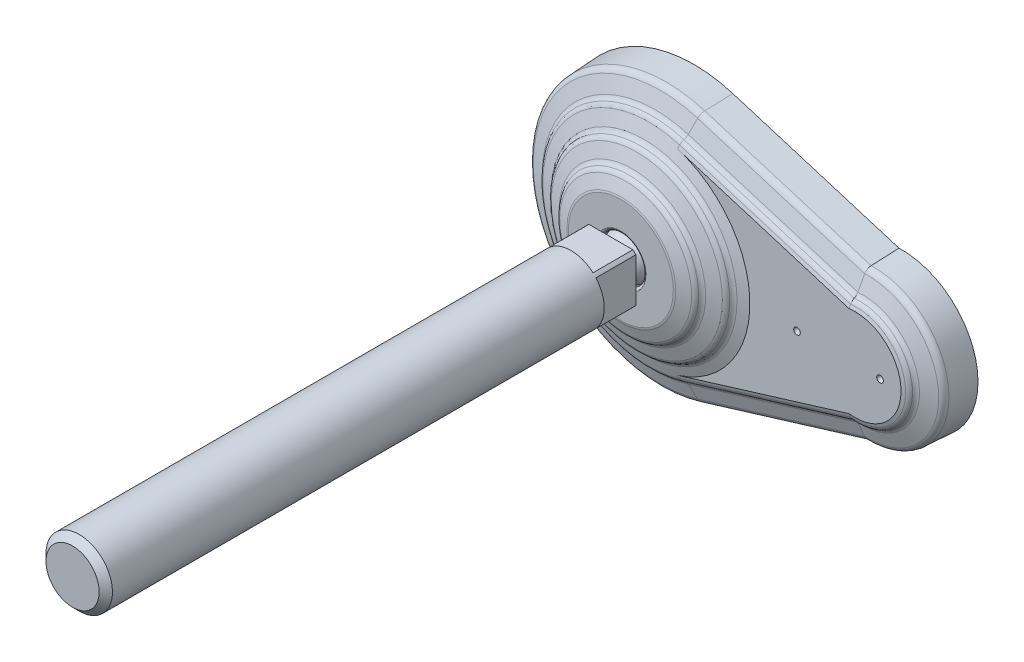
ISO-10303-21;
HEADER;
FILE_DESCRIPTION(('STEP AP214'),'2;1');
FILE_NAME('part.step','',(''),(''),'','','');
FILE_SCHEMA(('AUTOMOTIVE_DESIGN { 1 0 10303 214 1 1 1 1 }'));
ENDSEC;
DATA;
#1=APPLICATION_CONTEXT('core data for automotive mechanical design processes');
#2=APPLICATION_PROTOCOL_DEFINITION('international standard','automotive_design',2000,#1);
#3=PRODUCT_CONTEXT('',#1,'mechanical');
#4=PRODUCT('Part','Part','',(#3));
#5=PRODUCT_RELATED_PRODUCT_CATEGORY('part','',(#4));
#6=PRODUCT_DEFINITION_FORMATION('','',#4);
#7=PRODUCT_DEFINITION_CONTEXT('part definition',#1,'design');
#8=PRODUCT_DEFINITION('design','',#6,#7);
#9=PRODUCT_DEFINITION_SHAPE('','',#8);
#10=(LENGTH_UNIT() NAMED_UNIT(*) SI_UNIT(.MILLI.,.METRE.));
#11=(NAMED_UNIT(*) PLANE_ANGLE_UNIT() SI_UNIT($,.RADIAN.));
#12=(NAMED_UNIT(*) SI_UNIT($,.STERADIAN.) SOLID_ANGLE_UNIT());
#13=UNCERTAINTY_MEASURE_WITH_UNIT(LENGTH_MEASURE(1.E-05),#10,'distance_accuracy_value','');
#14=(GEOMETRIC_REPRESENTATION_CONTEXT(3) GLOBAL_UNCERTAINTY_ASSIGNED_CONTEXT((#13)) GLOBAL_UNIT_ASSIGNED_CONTEXT((#10,
#11,#12)) REPRESENTATION_CONTEXT('',''));
#15=CARTESIAN_POINT('',(0.,0.,0.));
#16=DIRECTION('',(0.,0.,1.));
#17=DIRECTION('',(1.,0.,0.));
#18=AXIS2_PLACEMENT_3D('',#15,#16,#17);
#19=CARTESIAN_POINT('',(0.,0.,37.));
#20=DIRECTION('',(0.,0.,1.));
#21=DIRECTION('',(-1.,0.,0.));
#22=AXIS2_PLACEMENT_3D('',#19,#20,#21);
#23=CYLINDRICAL_SURFACE('',#22,10.);
#24=CARTESIAN_POINT('',(0.,0.,185.));
#25=DIRECTION('',(0.,0.,1.));
#26=DIRECTION('',(-1.,0.,0.));
#27=AXIS2_PLACEMENT_3D('',#24,#25,#26);
#28=CIRCLE('',#27,10.);
#29=CARTESIAN_POINT('',(-10.,0.,185.));
#30=VERTEX_POINT('',#29);
#31=EDGE_CURVE('E9',#30,#30,#28,.F.);
#32=ORIENTED_EDGE('',*,*,#31,.T.);
#33=EDGE_LOOP('',(#32));
#34=FACE_BOUND('',#33,.T.);
#35=DIRECTION('',(0.,0.,1.));
#36=VECTOR('',#35,1.);
#37=CARTESIAN_POINT('',(-6.61437827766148,-7.5,37.));
#38=LINE('',#37,#36);
#39=CARTESIAN_POINT('',(-6.61437827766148,-7.5,37.));
#40=VERTEX_POINT('',#39);
#41=CARTESIAN_POINT('',(-6.61437827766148,-7.5,25.));
#42=VERTEX_POINT('',#41);
#43=EDGE_CURVE('E135',#40,#42,#38,.F.);
#44=ORIENTED_EDGE('',*,*,#43,.F.);
#45=CARTESIAN_POINT('',(0.,0.,37.));
#46=DIRECTION('',(0.,0.,1.));
#47=DIRECTION('',(0.,-1.,0.));
#48=AXIS2_PLACEMENT_3D('',#45,#46,#47);
#49=CIRCLE('',#48,10.);
#50=CARTESIAN_POINT('',(6.61437827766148,-7.5,37.));
#51=VERTEX_POINT('',#50);
#52=EDGE_CURVE('E506',#40,#51,#49,.T.);
#53=ORIENTED_EDGE('',*,*,#52,.T.);
#54=DIRECTION('',(0.,0.,1.));
#55=VECTOR('',#54,1.);
#56=CARTESIAN_POINT('',(6.61437827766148,-7.5,37.));
#57=LINE('',#56,#55);
#58=CARTESIAN_POINT('',(6.61437827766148,-7.5,25.));
#59=VERTEX_POINT('',#58);
#60=EDGE_CURVE('E200',#59,#51,#57,.T.);
#61=ORIENTED_EDGE('',*,*,#60,.F.);
#62=CARTESIAN_POINT('',(0.,0.,25.));
#63=DIRECTION('',(0.,0.,1.));
#64=DIRECTION('',(-1.,0.,0.));
#65=AXIS2_PLACEMENT_3D('',#62,#63,#64);
#66=CIRCLE('',#65,10.);
#67=CARTESIAN_POINT('',(7.5,-6.61437827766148,25.));
#68=VERTEX_POINT('',#67);
#69=EDGE_CURVE('E183',#59,#68,#66,.T.);
#70=ORIENTED_EDGE('',*,*,#69,.T.);
#71=DIRECTION('',(0.,0.,1.));
#72=VECTOR('',#71,1.);
#73=CARTESIAN_POINT('',(7.5,-6.61437827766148,37.));
#74=LINE('',#73,#72);
#75=CARTESIAN_POINT('',(7.5,-6.61437827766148,37.));
#76=VERTEX_POINT('',#75);
#77=EDGE_CURVE('E197',#76,#68,#74,.F.);
#78=ORIENTED_EDGE('',*,*,#77,.F.);
#79=CARTESIAN_POINT('',(7.5,6.61437827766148,37.));
#80=VERTEX_POINT('',#79);
#81=EDGE_CURVE('E265',#76,#80,#49,.T.);
#82=ORIENTED_EDGE('',*,*,#81,.T.);
#83=DIRECTION('',(0.,0.,1.));
#84=VECTOR('',#83,1.);
#85=CARTESIAN_POINT('',(7.5,6.61437827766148,37.));
#86=LINE('',#85,#84);
#87=CARTESIAN_POINT('',(7.5,6.61437827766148,25.));
#88=VERTEX_POINT('',#87);
#89=EDGE_CURVE('E242',#88,#80,#86,.T.);
#90=ORIENTED_EDGE('',*,*,#89,.F.);
#91=CARTESIAN_POINT('',(6.61437827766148,7.5,25.));
#92=VERTEX_POINT('',#91);
#93=EDGE_CURVE('E179',#88,#92,#66,.T.);
#94=ORIENTED_EDGE('',*,*,#93,.T.);
#95=DIRECTION('',(0.,0.,1.));
#96=VECTOR('',#95,1.);
#97=CARTESIAN_POINT('',(6.61437827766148,7.5,37.));
#98=LINE('',#97,#96);
#99=CARTESIAN_POINT('',(6.61437827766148,7.5,37.));
#100=VERTEX_POINT('',#99);
#101=EDGE_CURVE('E160',#100,#92,#98,.F.);
#102=ORIENTED_EDGE('',*,*,#101,.F.);
#103=CARTESIAN_POINT('',(-6.61437827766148,7.5,37.));
#104=VERTEX_POINT('',#103);
#105=EDGE_CURVE('E173',#100,#104,#49,.T.);
#106=ORIENTED_EDGE('',*,*,#105,.T.);
#107=DIRECTION('',(0.,0.,1.));
#108=VECTOR('',#107,1.);
#109=CARTESIAN_POINT('',(-6.61437827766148,7.5,37.));
#110=LINE('',#109,#108);
#111=CARTESIAN_POINT('',(-6.61437827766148,7.5,25.));
#112=VERTEX_POINT('',#111);
#113=EDGE_CURVE('E158',#112,#104,#110,.T.);
#114=ORIENTED_EDGE('',*,*,#113,.F.);
#115=CARTESIAN_POINT('',(-7.5,6.61437827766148,25.));
#116=VERTEX_POINT('',#115);
#117=EDGE_CURVE('E171',#112,#116,#66,.T.);
#118=ORIENTED_EDGE('',*,*,#117,.T.);
#119=DIRECTION('',(0.,0.,1.));
#120=VECTOR('',#119,1.);
#121=CARTESIAN_POINT('',(-7.5,6.61437827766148,37.));
#122=LINE('',#121,#120);
#123=CARTESIAN_POINT('',(-7.5,6.61437827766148,37.));
#124=VERTEX_POINT('',#123);
#125=EDGE_CURVE('E174',#124,#116,#122,.F.);
#126=ORIENTED_EDGE('',*,*,#125,.F.);
#127=CARTESIAN_POINT('',(-7.5,-6.61437827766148,37.));
#128=VERTEX_POINT('',#127);
#129=EDGE_CURVE('E516',#124,#128,#49,.T.);
#130=ORIENTED_EDGE('',*,*,#129,.T.);
#131=DIRECTION('',(0.,0.,1.));
#132=VECTOR('',#131,1.);
#133=CARTESIAN_POINT('',(-7.5,-6.61437827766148,37.));
#134=LINE('',#133,#132);
#135=CARTESIAN_POINT('',(-7.5,-6.61437827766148,25.));
#136=VERTEX_POINT('',#135);
#137=EDGE_CURVE('E180',#136,#128,#134,.T.);
#138=ORIENTED_EDGE('',*,*,#137,.F.);
#139=EDGE_CURVE('E182',#136,#42,#66,.T.);
#140=ORIENTED_EDGE('',*,*,#139,.T.);
#141=EDGE_LOOP('',(#44,#53,#61,#70,#78,#82,#90,#94,#102,#106,#114,#118,#126,#130,#138,#140));
#142=FACE_BOUND('',#141,.T.);
#143=ADVANCED_FACE('F14',(#34,#142),#23,.T.);
#144=CARTESIAN_POINT('',(-5.26544933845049,0.,25.));
#145=DIRECTION('',(0.,0.,1.));
#146=DIRECTION('',(-1.,0.,0.));
#147=AXIS2_PLACEMENT_3D('',#144,#145,#146);
#148=PLANE('',#147);
#149=DIRECTION('',(0.,-1.,0.));
#150=VECTOR('',#149,1.);
#151=CARTESIAN_POINT('',(-7.5,7.5,25.));
#152=LINE('',#151,#150);
#153=EDGE_CURVE('E31',#116,#136,#152,.T.);
#154=ORIENTED_EDGE('',*,*,#153,.F.);
#155=ORIENTED_EDGE('',*,*,#117,.F.);
#156=DIRECTION('',(-1.,0.,0.));
#157=VECTOR('',#156,1.);
#158=CARTESIAN_POINT('',(7.5,7.5,25.));
#159=LINE('',#158,#157);
#160=EDGE_CURVE('E153',#92,#112,#159,.T.);
#161=ORIENTED_EDGE('',*,*,#160,.F.);
#162=ORIENTED_EDGE('',*,*,#93,.F.);
#163=DIRECTION('',(0.,1.,0.));
#164=VECTOR('',#163,1.);
#165=CARTESIAN_POINT('',(7.5,-7.5,25.));
#166=LINE('',#165,#164);
#167=EDGE_CURVE('E165',#68,#88,#166,.T.);
#168=ORIENTED_EDGE('',*,*,#167,.F.);
#169=ORIENTED_EDGE('',*,*,#69,.F.);
#170=DIRECTION('',(1.,0.,0.));
#171=VECTOR('',#170,1.);
#172=CARTESIAN_POINT('',(-7.5,-7.5,25.));
#173=LINE('',#172,#171);
#174=EDGE_CURVE('E202',#42,#59,#173,.T.);
#175=ORIENTED_EDGE('',*,*,#174,.F.);
#176=ORIENTED_EDGE('',*,*,#139,.F.);
#177=EDGE_LOOP('',(#154,#155,#161,#162,#168,#169,#175,#176));
#178=FACE_BOUND('',#177,.T.);
#179=CARTESIAN_POINT('',(0.,0.,25.));
#180=DIRECTION('',(0.,0.,1.));
#181=DIRECTION('',(-1.,0.,0.));
#182=AXIS2_PLACEMENT_3D('',#179,#180,#181);
#183=CIRCLE('',#182,5.26544933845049);
#184=CARTESIAN_POINT('',(-5.26544933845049,0.,25.));
#185=VERTEX_POINT('',#184);
#186=EDGE_CURVE('E188',#185,#185,#183,.T.);
#187=ORIENTED_EDGE('',*,*,#186,.T.);
#188=EDGE_LOOP('',(#187));
#189=FACE_BOUND('',#188,.T.);
#190=ADVANCED_FACE('F176',(#178,#189),#148,.F.);
#191=CARTESIAN_POINT('',(0.,0.,18.6509999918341));
#192=DIRECTION('',(0.,0.,1.));
#193=DIRECTION('',(-1.,0.,0.));
#194=AXIS2_PLACEMENT_3D('',#191,#192,#193);
#195=DEGENERATE_TOROIDAL_SURFACE('',#194,0.000333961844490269,6.829,.T.);
#196=CARTESIAN_POINT('',(0.,0.,19.794));
#197=DIRECTION('',(0.,0.,-1.));
#198=DIRECTION('',(1.,0.,0.));
#199=AXIS2_PLACEMENT_3D('',#196,#197,#198);
#200=CIRCLE('',#199,6.733);
#201=CARTESIAN_POINT('',(6.733,0.,19.794));
#202=VERTEX_POINT('',#201);
#203=EDGE_CURVE('E249',#202,#202,#200,.T.);
#204=ORIENTED_EDGE('',*,*,#203,.F.);
#205=EDGE_LOOP('',(#204));
#206=FACE_BOUND('',#205,.T.);
#207=CARTESIAN_POINT('',(0.,0.,23.));
#208=DIRECTION('',(0.,0.,1.));
#209=DIRECTION('',(-1.,0.,0.));
#210=AXIS2_PLACEMENT_3D('',#207,#208,#209);
#211=CIRCLE('',#210,5.26544933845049);
#212=CARTESIAN_POINT('',(-5.26544933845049,0.,23.));
#213=VERTEX_POINT('',#212);
#214=EDGE_CURVE('E190',#213,#213,#211,.T.);
#215=ORIENTED_EDGE('',*,*,#214,.F.);
#216=EDGE_LOOP('',(#215));
#217=FACE_BOUND('',#216,.T.);
#218=ADVANCED_FACE('F450',(#206,#217),#195,.T.);
#219=CARTESIAN_POINT('',(0.,0.,37.));
#220=DIRECTION('',(0.,0.,1.));
#221=DIRECTION('',(-1.,0.,0.));
#222=AXIS2_PLACEMENT_3D('',#219,#220,#221);
#223=CYLINDRICAL_SURFACE('',#222,5.26544933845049);
#224=ORIENTED_EDGE('',*,*,#186,.F.);
#225=EDGE_LOOP('',(#224));
#226=FACE_BOUND('',#225,.T.);
#227=ORIENTED_EDGE('',*,*,#214,.T.);
#228=EDGE_LOOP('',(#227));
#229=FACE_BOUND('',#228,.T.);
#230=ADVANCED_FACE('F529',(#226,#229),#223,.T.);
#231=CARTESIAN_POINT('',(-7.5,-7.5,25.));
#232=DIRECTION('',(0.,-1.,0.));
#233=DIRECTION('',(1.,0.,0.));
#234=AXIS2_PLACEMENT_3D('',#231,#232,#233);
#235=PLANE('',#234);
#236=ORIENTED_EDGE('',*,*,#60,.T.);
#237=DIRECTION('',(-1.,0.,0.));
#238=VECTOR('',#237,1.);
#239=CARTESIAN_POINT('',(-10.,-7.5,37.));
#240=LINE('',#239,#238);
#241=EDGE_CURVE('E214',#51,#40,#240,.T.);
#242=ORIENTED_EDGE('',*,*,#241,.T.);
#243=ORIENTED_EDGE('',*,*,#43,.T.);
#244=ORIENTED_EDGE('',*,*,#174,.T.);
#245=EDGE_LOOP('',(#236,#242,#243,#244));
#246=FACE_BOUND('',#245,.T.);
#247=ADVANCED_FACE('F525',(#246),#235,.T.);
#248=CARTESIAN_POINT('',(7.5,-7.5,25.));
#249=DIRECTION('',(1.,0.,0.));
#250=DIRECTION('',(0.,1.,0.));
#251=AXIS2_PLACEMENT_3D('',#248,#249,#250);
#252=PLANE('',#251);
#253=ORIENTED_EDGE('',*,*,#89,.T.);
#254=DIRECTION('',(0.,-1.,0.));
#255=VECTOR('',#254,1.);
#256=CARTESIAN_POINT('',(7.5,0.,37.));
#257=LINE('',#256,#255);
#258=EDGE_CURVE('E221',#80,#76,#257,.T.);
#259=ORIENTED_EDGE('',*,*,#258,.T.);
#260=ORIENTED_EDGE('',*,*,#77,.T.);
#261=ORIENTED_EDGE('',*,*,#167,.T.);
#262=EDGE_LOOP('',(#253,#259,#260,#261));
#263=FACE_BOUND('',#262,.T.);
#264=ADVANCED_FACE('F540',(#263),#252,.T.);
#265=CARTESIAN_POINT('',(7.5,7.5,25.));
#266=DIRECTION('',(0.,1.,0.));
#267=DIRECTION('',(-1.,0.,0.));
#268=AXIS2_PLACEMENT_3D('',#265,#266,#267);
#269=PLANE('',#268);
#270=ORIENTED_EDGE('',*,*,#113,.T.);
#271=DIRECTION('',(1.,0.,0.));
#272=VECTOR('',#271,1.);
#273=CARTESIAN_POINT('',(-10.,7.5,37.));
#274=LINE('',#273,#272);
#275=EDGE_CURVE('E225',#104,#100,#274,.T.);
#276=ORIENTED_EDGE('',*,*,#275,.T.);
#277=ORIENTED_EDGE('',*,*,#101,.T.);
#278=ORIENTED_EDGE('',*,*,#160,.T.);
#279=EDGE_LOOP('',(#270,#276,#277,#278));
#280=FACE_BOUND('',#279,.T.);
#281=ADVANCED_FACE('F155',(#280),#269,.T.);
#282=CARTESIAN_POINT('',(-7.5,7.5,25.));
#283=DIRECTION('',(-1.,0.,0.));
#284=DIRECTION('',(0.,-1.,0.));
#285=AXIS2_PLACEMENT_3D('',#282,#283,#284);
#286=PLANE('',#285);
#287=ORIENTED_EDGE('',*,*,#137,.T.);
#288=DIRECTION('',(0.,1.,0.));
#289=VECTOR('',#288,1.);
#290=CARTESIAN_POINT('',(-7.5,0.,37.));
#291=LINE('',#290,#289);
#292=EDGE_CURVE('E238',#128,#124,#291,.T.);
#293=ORIENTED_EDGE('',*,*,#292,.T.);
#294=ORIENTED_EDGE('',*,*,#125,.T.);
#295=ORIENTED_EDGE('',*,*,#153,.T.);
#296=EDGE_LOOP('',(#287,#293,#294,#295));
#297=FACE_BOUND('',#296,.T.);
#298=ADVANCED_FACE('F461',(#297),#286,.T.);
#299=CARTESIAN_POINT('',(62.5,0.,0.));
#300=DIRECTION('',(0.,0.,-1.));
#301=DIRECTION('',(0.,1.,0.));
#302=AXIS2_PLACEMENT_3D('',#299,#300,#301);
#303=CONICAL_SURFACE('',#302,22.9787234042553,0.0523365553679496);
#304=CARTESIAN_POINT('',(62.5,0.,8.30411735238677));
#305=DIRECTION('',(0.,0.,1.));
#306=DIRECTION('',(0.,-1.,0.));
#307=AXIS2_PLACEMENT_3D('',#304,#305,#306);
#308=CIRCLE('',#307,22.5437172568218);
#309=CARTESIAN_POINT('',(61.6407011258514,-22.5273343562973,8.30411735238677));
#310=VERTEX_POINT('',#309);
#311=CARTESIAN_POINT('',(61.6407011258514,22.5273343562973,8.30411735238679));
#312=VERTEX_POINT('',#311);
#313=EDGE_CURVE('E284',#310,#312,#308,.T.);
#314=ORIENTED_EDGE('',*,*,#313,.F.);
#315=CARTESIAN_POINT('',(61.6406997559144,-22.5273238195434,8.30431735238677));
#316=CARTESIAN_POINT('',(61.6501805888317,-22.600242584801,6.92023165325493));
#317=CARTESIAN_POINT('',(61.6596900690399,-22.6731526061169,5.53614569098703));
#318=CARTESIAN_POINT('',(61.6787663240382,-22.8189551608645,2.76797324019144));
#319=CARTESIAN_POINT('',(61.6883330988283,-22.8918476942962,1.38388675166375));
#320=CARTESIAN_POINT('',(61.6979285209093,-22.9647314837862,-0.00020000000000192));
#321=B_SPLINE_CURVE_WITH_KNOTS('',3,(#315,#316,#317,#318,#319,#320),.UNSPECIFIED.,.F.,.F.,(4,2,
4),(0.,4.15811282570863,8.31622565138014),.UNSPECIFIED.);
#322=CARTESIAN_POINT('',(61.697927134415,-22.9647209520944,0.));
#323=VERTEX_POINT('',#322);
#324=EDGE_CURVE('E691',#310,#323,#321,.T.);
#325=ORIENTED_EDGE('',*,*,#324,.T.);
#326=CARTESIAN_POINT('',(62.5,0.,0.));
#327=DIRECTION('',(0.,0.,1.));
#328=DIRECTION('',(0.,-1.,0.));
#329=AXIS2_PLACEMENT_3D('',#326,#327,#328);
#330=CIRCLE('',#329,22.9787234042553);
#331=CARTESIAN_POINT('',(61.6979271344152,22.9647209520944,0.));
#332=VERTEX_POINT('',#331);
#333=EDGE_CURVE('E286',#323,#332,#330,.T.);
#334=ORIENTED_EDGE('',*,*,#333,.T.);
#335=CARTESIAN_POINT('',(61.6979285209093,22.9647314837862,-0.00019999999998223));
#336=CARTESIAN_POINT('',(61.6883330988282,22.8918476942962,1.38388675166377));
#337=CARTESIAN_POINT('',(61.6787663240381,22.8189551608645,2.76797324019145));
#338=CARTESIAN_POINT('',(61.6596900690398,22.6731526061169,5.53614569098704));
#339=CARTESIAN_POINT('',(61.6501805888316,22.600242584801,6.92023165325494));
#340=CARTESIAN_POINT('',(61.6406997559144,22.5273238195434,8.30431735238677));
#341=B_SPLINE_CURVE_WITH_KNOTS('',3,(#335,#336,#337,#338,#339,#340),.UNSPECIFIED.,.F.,.F.,(4,2,
4),(0.,4.1581128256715,8.31622565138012),.UNSPECIFIED.);
#342=EDGE_CURVE('E700',#332,#312,#341,.T.);
#343=ORIENTED_EDGE('',*,*,#342,.T.);
#344=EDGE_LOOP('',(#314,#325,#334,#343));
#345=FACE_BOUND('',#344,.T.);
#346=ADVANCED_FACE('F455',(#345),#303,.T.);
#347=CARTESIAN_POINT('',(64.1644462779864,-21.755748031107,8.30411735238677));
#348=DIRECTION('',(-0.291971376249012,0.9549953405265,-0.0523126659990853));
#349=DIRECTION('',(-0.956304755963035,-0.292371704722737,0.));
#350=AXIS2_PLACEMENT_3D('',#347,#348,#349);
#351=PLANE('',#350);
#352=ORIENTED_EDGE('',*,*,#324,.F.);
#353=DIRECTION('',(-0.956304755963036,-0.292371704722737,0.));
#354=VECTOR('',#353,1.);
#355=CARTESIAN_POINT('',(64.1644462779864,-21.755748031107,8.30411735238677));
#356=LINE('',#355,#354);
#357=CARTESIAN_POINT('',(11.5676847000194,-37.8361917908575,8.30411735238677));
#358=VERTEX_POINT('',#357);
#359=EDGE_CURVE('E620',#310,#358,#356,.T.);
#360=ORIENTED_EDGE('',*,*,#359,.T.);
#361=DIRECTION('',(-0.0152947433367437,0.050026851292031,0.998630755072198));
#362=VECTOR('',#361,1.);
#363=CARTESIAN_POINT('',(11.6948681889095,-38.2521902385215,0.));
#364=LINE('',#363,#362);
#365=CARTESIAN_POINT('',(11.6948681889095,-38.2521902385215,0.));
#366=VERTEX_POINT('',#365);
#367=EDGE_CURVE('E633',#366,#358,#364,.T.);
#368=ORIENTED_EDGE('',*,*,#367,.F.);
#369=DIRECTION('',(-0.956304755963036,-0.292371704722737,0.));
#370=VECTOR('',#369,1.);
#371=CARTESIAN_POINT('',(64.2916297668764,-22.1717464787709,0.));
#372=LINE('',#371,#370);
#373=EDGE_CURVE('E126',#323,#366,#372,.T.);
#374=ORIENTED_EDGE('',*,*,#373,.F.);
#375=EDGE_LOOP('',(#352,#360,#368,#374));
#376=FACE_BOUND('',#375,.T.);
#377=ADVANCED_FACE('F446',(#376),#351,.F.);
#378=CARTESIAN_POINT('',(0.,0.,0.));
#379=DIRECTION('',(0.,0.,1.));
#380=DIRECTION('',(-1.,0.,0.));
#381=AXIS2_PLACEMENT_3D('',#378,#379,#380);
#382=PLANE('',#381);
#383=DIRECTION('',(-0.956304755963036,0.292371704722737,0.));
#384=VECTOR('',#383,1.);
#385=CARTESIAN_POINT('',(64.2916297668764,22.1717464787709,0.));
#386=LINE('',#385,#384);
#387=CARTESIAN_POINT('',(11.6948681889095,38.2521902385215,0.));
#388=VERTEX_POINT('',#387);
#389=EDGE_CURVE('E618',#332,#388,#386,.T.);
#390=ORIENTED_EDGE('',*,*,#389,.F.);
#391=ORIENTED_EDGE('',*,*,#333,.F.);
#392=ORIENTED_EDGE('',*,*,#373,.T.);
#393=CARTESIAN_POINT('',(0.,0.,0.));
#394=DIRECTION('',(0.,0.,1.));
#395=DIRECTION('',(-1.,0.,0.));
#396=AXIS2_PLACEMENT_3D('',#393,#394,#395);
#397=CIRCLE('',#396,40.);
#398=EDGE_CURVE('E327',#388,#366,#397,.T.);
#399=ORIENTED_EDGE('',*,*,#398,.F.);
#400=EDGE_LOOP('',(#390,#391,#392,#399));
#401=FACE_BOUND('',#400,.T.);
#402=CARTESIAN_POINT('',(45.,0.,0.));
#403=DIRECTION('',(0.,0.,-1.));
#404=DIRECTION('',(0.,1.,0.));
#405=AXIS2_PLACEMENT_3D('',#402,#403,#404);
#406=CIRCLE('',#405,5.25);
#407=CARTESIAN_POINT('',(45.,5.25,0.));
#408=VERTEX_POINT('',#407);
#409=EDGE_CURVE('E503',#408,#408,#406,.T.);
#410=ORIENTED_EDGE('',*,*,#409,.F.);
#411=EDGE_LOOP('',(#410));
#412=FACE_BOUND('',#411,.T.);
#413=CARTESIAN_POINT('',(70.,0.,0.));
#414=DIRECTION('',(0.,0.,-1.));
#415=DIRECTION('',(0.,1.,0.));
#416=AXIS2_PLACEMENT_3D('',#413,#414,#415);
#417=CIRCLE('',#416,5.25);
#418=CARTESIAN_POINT('',(70.,5.25,0.));
#419=VERTEX_POINT('',#418);
#420=EDGE_CURVE('E500',#419,#419,#417,.T.);
#421=ORIENTED_EDGE('',*,*,#420,.F.);
#422=EDGE_LOOP('',(#421));
#423=FACE_BOUND('',#422,.T.);
#424=ADVANCED_FACE('F336',(#401,#412,#423),#382,.F.);
#425=CARTESIAN_POINT('',(64.2916297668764,22.1717464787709,0.));
#426=DIRECTION('',(-0.291971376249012,-0.9549953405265,-0.0523126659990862));
#427=DIRECTION('',(0.956304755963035,-0.292371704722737,0.));
#428=AXIS2_PLACEMENT_3D('',#425,#426,#427);
#429=PLANE('',#428);
#430=ORIENTED_EDGE('',*,*,#342,.F.);
#431=ORIENTED_EDGE('',*,*,#389,.T.);
#432=DIRECTION('',(-0.0152947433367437,-0.050026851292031,0.998630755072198));
#433=VECTOR('',#432,1.);
#434=CARTESIAN_POINT('',(11.6948681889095,38.2521902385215,0.));
#435=LINE('',#434,#433);
#436=CARTESIAN_POINT('',(11.5676847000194,37.8361917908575,8.30411735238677));
#437=VERTEX_POINT('',#436);
#438=EDGE_CURVE('E651',#388,#437,#435,.T.);
#439=ORIENTED_EDGE('',*,*,#438,.T.);
#440=DIRECTION('',(-0.956304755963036,0.292371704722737,0.));
#441=VECTOR('',#440,1.);
#442=CARTESIAN_POINT('',(64.1644462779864,21.755748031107,8.30411735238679));
#443=LINE('',#442,#441);
#444=EDGE_CURVE('E616',#312,#437,#443,.T.);
#445=ORIENTED_EDGE('',*,*,#444,.F.);
#446=EDGE_LOOP('',(#430,#431,#439,#445));
#447=FACE_BOUND('',#446,.T.);
#448=ADVANCED_FACE('F416',(#447),#429,.F.);
#449=CARTESIAN_POINT('',(62.5,0.,8.19912580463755));
#450=DIRECTION('',(0.,0.,1.));
#451=DIRECTION('',(0.,-1.,0.));
#452=AXIS2_PLACEMENT_3D('',#449,#450,#451);
#453=TOROIDAL_SURFACE('',#452,20.5394653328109,2.007);
#454=CARTESIAN_POINT('',(61.6407233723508,-22.5275054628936,8.09743405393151));
#455=CARTESIAN_POINT('',(61.6409510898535,-22.5292569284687,8.13179934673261));
#456=CARTESIAN_POINT('',(61.6410635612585,-22.5301219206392,8.16619641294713));
#457=CARTESIAN_POINT('',(61.6410572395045,-22.5300732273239,8.23504586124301));
#458=CARTESIAN_POINT('',(61.6409380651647,-22.5291566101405,8.26949824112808));
#459=CARTESIAN_POINT('',(61.6399396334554,-22.5214778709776,8.41537858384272));
#460=CARTESIAN_POINT('',(61.6379561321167,-22.5062239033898,8.52649092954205));
#461=CARTESIAN_POINT('',(61.6316126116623,-22.4573679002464,8.74462326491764));
#462=CARTESIAN_POINT('',(61.6272490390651,-22.4237384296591,8.85163687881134));
#463=CARTESIAN_POINT('',(61.6163034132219,-22.339189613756,9.05835724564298));
#464=CARTESIAN_POINT('',(61.6097238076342,-22.2882893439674,9.1580719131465));
#465=CARTESIAN_POINT('',(61.5945702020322,-22.1707054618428,9.34754679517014));
#466=CARTESIAN_POINT('',(61.5859960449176,-22.1040206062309,9.43730622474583));
#467=CARTESIAN_POINT('',(61.5670698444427,-21.9562760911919,9.60507832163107));
#468=CARTESIAN_POINT('',(61.5567047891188,-21.8751110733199,9.68299656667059));
#469=CARTESIAN_POINT('',(61.5345911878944,-21.7011851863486,9.82410142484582));
#470=CARTESIAN_POINT('',(61.5228449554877,-21.6084436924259,9.88731215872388));
#471=CARTESIAN_POINT('',(61.5046129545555,-21.4637836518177,9.96928669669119));
#472=CARTESIAN_POINT('',(61.4985079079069,-21.4152343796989,9.99425235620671));
#473=CARTESIAN_POINT('',(61.4860940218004,-21.3162718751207,10.0401972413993));
#474=CARTESIAN_POINT('',(61.4797850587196,-21.2658575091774,10.0611739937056));
#475=CARTESIAN_POINT('',(61.4596293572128,-21.1043762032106,10.1208327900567));
#476=CARTESIAN_POINT('',(61.4454888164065,-20.9904779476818,10.1519983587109));
#477=CARTESIAN_POINT('',(61.4169436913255,-20.7591475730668,10.1941665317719));
#478=CARTESIAN_POINT('',(61.4025394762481,-20.6417202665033,10.2051954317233));
#479=CARTESIAN_POINT('',(61.3876252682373,-20.5193667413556,10.2061070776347));
#480=CARTESIAN_POINT('',(61.3870090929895,-20.5143103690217,10.2061258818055));
#481=CARTESIAN_POINT('',(61.3863931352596,-20.5092543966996,10.2061258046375));
#482=B_SPLINE_CURVE_WITH_KNOTS('',3,(#454,#455,#456,#457,#458,#459,#460,#461,#462,#463,#464,
#465,#466,#467,#468,#469,#470,#471,#472,#473,#474,#475,#476,#477,#478,#479,#480,#481),
.UNSPECIFIED.,.F.,.F.,(4,2,2,2,2,2,2,2,2,2,2,2,2,4),(0.,0.103191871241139,0.20655369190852,
0.54127575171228,0.87649892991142,1.21135305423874,1.54623356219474,1.88365820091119,
2.2205254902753,2.38517216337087,2.54992059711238,2.90486008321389,3.2593357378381,
3.2746170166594),.UNSPECIFIED.);
#483=CARTESIAN_POINT('',(61.4734629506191,-21.2152067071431,10.0798866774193));
#484=VERTEX_POINT('',#483);
#485=EDGE_CURVE('E693',#310,#484,#482,.T.);
#486=ORIENTED_EDGE('',*,*,#485,.F.);
#487=ORIENTED_EDGE('',*,*,#313,.T.);
#488=CARTESIAN_POINT('',(61.3863931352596,20.5092543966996,10.2061258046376));
#489=CARTESIAN_POINT('',(61.3870091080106,20.5143104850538,10.2061258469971));
#490=CARTESIAN_POINT('',(61.3876252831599,20.5193668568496,10.206107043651));
#491=CARTESIAN_POINT('',(61.3988855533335,20.6117442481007,10.2054193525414));
#492=CARTESIAN_POINT('',(61.4095840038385,20.6991031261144,10.1991511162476));
#493=CARTESIAN_POINT('',(61.4308936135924,20.8723273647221,10.1754412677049));
#494=CARTESIAN_POINT('',(61.4415047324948,20.9581920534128,10.1579947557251));
#495=CARTESIAN_POINT('',(61.4555813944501,21.0716202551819,10.1272225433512));
#496=CARTESIAN_POINT('',(61.4591730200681,21.1005182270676,10.1186877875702));
#497=CARTESIAN_POINT('',(61.4663157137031,21.1579059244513,10.1003430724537));
#498=CARTESIAN_POINT('',(61.4698667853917,21.1863956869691,10.090533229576));
#499=CARTESIAN_POINT('',(61.4866782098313,21.3210820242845,10.0407628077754));
#500=CARTESIAN_POINT('',(61.4996430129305,21.4243838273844,9.99241683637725));
#501=CARTESIAN_POINT('',(61.5245148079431,21.6216549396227,9.87891981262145));
#502=CARTESIAN_POINT('',(61.5364193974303,21.7156031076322,9.81373183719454));
#503=CARTESIAN_POINT('',(61.5587594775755,21.8912250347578,9.66834297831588));
#504=CARTESIAN_POINT('',(61.5691956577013,21.9729045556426,9.58814918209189));
#505=CARTESIAN_POINT('',(61.5882470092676,22.1215501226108,9.41495435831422));
#506=CARTESIAN_POINT('',(61.5968625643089,22.1885192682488,9.32195603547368));
#507=CARTESIAN_POINT('',(61.6119005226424,22.3051440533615,9.12674801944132));
#508=CARTESIAN_POINT('',(61.6183432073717,22.3549598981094,9.02463544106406));
#509=CARTESIAN_POINT('',(61.6289130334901,22.4365717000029,8.81343456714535));
#510=CARTESIAN_POINT('',(61.6330436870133,22.4683949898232,8.70435713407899));
#511=CARTESIAN_POINT('',(61.6371976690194,22.5003783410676,8.54571963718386));
#512=CARTESIAN_POINT('',(61.6382205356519,22.5082502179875,8.49762935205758));
#513=CARTESIAN_POINT('',(61.639806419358,22.5204527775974,8.40103137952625));
#514=CARTESIAN_POINT('',(61.6403698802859,22.52478687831,8.35252414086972));
#515=CARTESIAN_POINT('',(61.6411729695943,22.5309631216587,8.23516417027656));
#516=CARTESIAN_POINT('',(61.641181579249,22.5310278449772,8.16621181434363));
#517=CARTESIAN_POINT('',(61.6407233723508,22.5275054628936,8.09743405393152));
#518=B_SPLINE_CURVE_WITH_KNOTS('',3,(#488,#489,#490,#491,#492,#493,#494,#495,#496,#497,#498,
#499,#500,#501,#502,#503,#504,#505,#506,#507,#508,#509,#510,#511,#512,#513,#514,#515,#516,#517),
.UNSPECIFIED.,.F.,.F.,(4,2,2,2,2,2,2,2,2,2,2,2,2,2,4),(0.,0.0152812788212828,0.27917431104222,
0.543183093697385,0.634194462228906,0.725197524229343,1.06775959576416,1.41107914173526,
1.75423694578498,2.09732237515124,2.43711059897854,2.77638125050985,2.92250118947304,
3.06847978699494,3.27496314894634),.UNSPECIFIED.);
#519=CARTESIAN_POINT('',(61.4734629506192,21.2152067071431,10.0798866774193));
#520=VERTEX_POINT('',#519);
#521=EDGE_CURVE('E405',#520,#312,#518,.T.);
#522=ORIENTED_EDGE('',*,*,#521,.F.);
#523=CARTESIAN_POINT('',(62.5,0.,10.0798866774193));
#524=DIRECTION('',(0.,0.,1.));
#525=DIRECTION('',(0.,-1.,0.));
#526=AXIS2_PLACEMENT_3D('',#523,#524,#525);
#527=CIRCLE('',#526,21.2400276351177);
#528=EDGE_CURVE('E282',#484,#520,#527,.T.);
#529=ORIENTED_EDGE('',*,*,#528,.F.);
#530=EDGE_LOOP('',(#486,#487,#522,#529));
#531=FACE_BOUND('',#530,.T.);
#532=ADVANCED_FACE('F387',(#531),#453,.T.);
#533=CARTESIAN_POINT('',(63.5784597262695,-19.8390723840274,8.19912580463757));
#534=DIRECTION('',(-0.956304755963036,-0.292371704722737,0.));
#535=DIRECTION('',(0.292371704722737,-0.956304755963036,0.));
#536=AXIS2_PLACEMENT_3D('',#533,#534,#535);
#537=CYLINDRICAL_SURFACE('',#536,2.00699999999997);
#538=ORIENTED_EDGE('',*,*,#359,.F.);
#539=ORIENTED_EDGE('',*,*,#485,.T.);
#540=DIRECTION('',(-0.956304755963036,-0.292371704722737,0.));
#541=VECTOR('',#540,1.);
#542=CARTESIAN_POINT('',(63.7832843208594,-20.5090234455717,10.0798866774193));
#543=LINE('',#542,#541);
#544=CARTESIAN_POINT('',(11.1865227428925,-36.5894672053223,10.0798866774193));
#545=VERTEX_POINT('',#544);
#546=EDGE_CURVE('E622',#484,#545,#543,.T.);
#547=ORIENTED_EDGE('',*,*,#546,.T.);
#548=CARTESIAN_POINT('',(10.9816981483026,-35.9195161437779,8.19912580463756));
#549=DIRECTION('',(0.956304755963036,0.292371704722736,0.));
#550=DIRECTION('',(-0.292371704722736,0.956304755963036,0.));
#551=AXIS2_PLACEMENT_3D('',#548,#549,#550);
#552=CIRCLE('',#551,2.007);
#553=EDGE_CURVE('E636',#545,#358,#552,.T.);
#554=ORIENTED_EDGE('',*,*,#553,.T.);
#555=EDGE_LOOP('',(#538,#539,#547,#554));
#556=FACE_BOUND('',#555,.T.);
#557=ADVANCED_FACE('F417',(#556),#537,.T.);
#558=CARTESIAN_POINT('',(0.,0.,0.));
#559=DIRECTION('',(0.,0.,-1.));
#560=DIRECTION('',(1.,0.,0.));
#561=AXIS2_PLACEMENT_3D('',#558,#559,#560);
#562=CONICAL_SURFACE('',#561,40.,0.0523365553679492);
#563=CARTESIAN_POINT('',(0.,0.,8.30411735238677));
#564=DIRECTION('',(0.,0.,1.));
#565=DIRECTION('',(-1.,0.,0.));
#566=AXIS2_PLACEMENT_3D('',#563,#564,#565);
#567=CIRCLE('',#566,39.5649938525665);
#568=EDGE_CURVE('E680',#437,#358,#567,.T.);
#569=ORIENTED_EDGE('',*,*,#568,.F.);
#570=ORIENTED_EDGE('',*,*,#438,.F.);
#571=ORIENTED_EDGE('',*,*,#398,.T.);
#572=ORIENTED_EDGE('',*,*,#367,.T.);
#573=EDGE_LOOP('',(#569,#570,#571,#572));
#574=FACE_BOUND('',#573,.T.);
#575=ADVANCED_FACE('F437',(#574),#562,.T.);
#576=CARTESIAN_POINT('',(63.5784597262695,19.8390723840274,8.1991258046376));
#577=DIRECTION('',(-0.956304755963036,0.292371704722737,0.));
#578=DIRECTION('',(-0.292371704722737,-0.956304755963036,0.));
#579=AXIS2_PLACEMENT_3D('',#576,#577,#578);
#580=CYLINDRICAL_SURFACE('',#579,2.00699999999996);
#581=DIRECTION('',(-0.956304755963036,0.292371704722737,0.));
#582=VECTOR('',#581,1.);
#583=CARTESIAN_POINT('',(63.7832843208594,20.5090234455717,10.0798866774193));
#584=LINE('',#583,#582);
#585=CARTESIAN_POINT('',(11.1865227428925,36.5894672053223,10.0798866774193));
#586=VERTEX_POINT('',#585);
#587=EDGE_CURVE('E614',#520,#586,#584,.T.);
#588=ORIENTED_EDGE('',*,*,#587,.F.);
#589=ORIENTED_EDGE('',*,*,#521,.T.);
#590=ORIENTED_EDGE('',*,*,#444,.T.);
#591=CARTESIAN_POINT('',(10.9816981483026,35.9195161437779,8.19912580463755));
#592=DIRECTION('',(-0.956304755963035,0.292371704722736,0.));
#593=DIRECTION('',(-0.292371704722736,-0.956304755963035,0.));
#594=AXIS2_PLACEMENT_3D('',#591,#592,#593);
#595=CIRCLE('',#594,2.007);
#596=EDGE_CURVE('E654',#586,#437,#595,.T.);
#597=ORIENTED_EDGE('',*,*,#596,.F.);
#598=EDGE_LOOP('',(#588,#589,#590,#597));
#599=FACE_BOUND('',#598,.T.);
#600=ADVANCED_FACE('F345',(#599),#580,.T.);
#601=CARTESIAN_POINT('',(62.5,0.,10.0798866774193));
#602=DIRECTION('',(0.,0.,-1.));
#603=DIRECTION('',(0.,1.,0.));
#604=AXIS2_PLACEMENT_3D('',#601,#602,#603);
#605=CONICAL_SURFACE('',#604,21.2400276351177,1.21422909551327);
#606=CARTESIAN_POINT('',(62.5,0.,11.656251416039));
#607=DIRECTION('',(0.,0.,1.));
#608=DIRECTION('',(0.,-1.,0.));
#609=AXIS2_PLACEMENT_3D('',#606,#607,#608);
#610=CIRCLE('',#609,17.0080484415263);
#611=CARTESIAN_POINT('',(60.9818619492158,-16.9401584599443,11.656251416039));
#612=VERTEX_POINT('',#611);
#613=CARTESIAN_POINT('',(60.9818619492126,16.9401584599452,11.656251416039));
#614=VERTEX_POINT('',#613);
#615=EDGE_CURVE('E280',#612,#614,#610,.T.);
#616=ORIENTED_EDGE('',*,*,#615,.F.);
#617=CARTESIAN_POINT('',(60.9818053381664,-16.9396143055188,11.656451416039));
#618=CARTESIAN_POINT('',(61.0189355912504,-17.2964789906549,11.5252879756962));
#619=CARTESIAN_POINT('',(61.0571375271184,-17.653206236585,11.3940567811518));
#620=CARTESIAN_POINT('',(61.1355151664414,-18.3663907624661,11.1314756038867));
#621=CARTESIAN_POINT('',(61.1756908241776,-18.7228480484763,11.0001256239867));
#622=CARTESIAN_POINT('',(61.2578477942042,-19.435511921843,10.7373183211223));
#623=CARTESIAN_POINT('',(61.2998290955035,-19.7917185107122,10.6058609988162));
#624=CARTESIAN_POINT('',(61.3854616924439,-20.5039033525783,10.3428458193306));
#625=CARTESIAN_POINT('',(61.4291130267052,-20.8598816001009,10.2112879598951));
#626=CARTESIAN_POINT('',(61.4735304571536,-21.2157475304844,10.0796866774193));
#627=B_SPLINE_CURVE_WITH_KNOTS('',3,(#617,#618,#619,#620,#621,#622,#623,#624,#625,#626),
.UNSPECIFIED.,.F.,.F.,(4,2,2,2,4),(0.,1.14603990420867,2.29205327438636,3.43805966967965,
4.58409258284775),.UNSPECIFIED.);
#628=EDGE_CURVE('E397',#612,#484,#627,.T.);
#629=ORIENTED_EDGE('',*,*,#628,.T.);
#630=ORIENTED_EDGE('',*,*,#528,.T.);
#631=CARTESIAN_POINT('',(61.4735304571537,21.2157475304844,10.0796866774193));
#632=CARTESIAN_POINT('',(61.4291130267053,20.8598816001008,10.2112879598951));
#633=CARTESIAN_POINT('',(61.3854616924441,20.5039033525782,10.3428458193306));
#634=CARTESIAN_POINT('',(61.2998290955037,19.7917185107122,10.6058609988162));
#635=CARTESIAN_POINT('',(61.2578477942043,19.435511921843,10.7373183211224));
#636=CARTESIAN_POINT('',(61.1756908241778,18.7228480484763,11.0001256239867));
#637=CARTESIAN_POINT('',(61.1355151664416,18.3663907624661,11.1314756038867));
#638=CARTESIAN_POINT('',(61.0571375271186,17.653206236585,11.3940567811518));
#639=CARTESIAN_POINT('',(61.0189355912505,17.2964789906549,11.5252879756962));
#640=CARTESIAN_POINT('',(60.9818053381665,16.9396143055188,11.656451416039));
#641=B_SPLINE_CURVE_WITH_KNOTS('',3,(#631,#632,#633,#634,#635,#636,#637,#638,#639,#640),
.UNSPECIFIED.,.F.,.F.,(4,2,2,2,4),(0.,1.1460329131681,2.29203930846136,3.43805267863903,
4.58409258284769),.UNSPECIFIED.);
#642=EDGE_CURVE('E391',#520,#614,#641,.T.);
#643=ORIENTED_EDGE('',*,*,#642,.T.);
#644=EDGE_LOOP('',(#616,#629,#630,#643));
#645=FACE_BOUND('',#644,.T.);
#646=ADVANCED_FACE('F380',(#645),#605,.T.);
#647=CARTESIAN_POINT('',(62.545973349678,-16.4619616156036,11.656251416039));
#648=DIRECTION('',(-0.102055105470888,0.333807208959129,-0.937100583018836));
#649=DIRECTION('',(0.,0.942019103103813,0.335559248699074));
#650=AXIS2_PLACEMENT_3D('',#647,#648,#649);
#651=PLANE('',#650);
#652=ORIENTED_EDGE('',*,*,#628,.F.);
#653=DIRECTION('',(-0.956304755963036,-0.292371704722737,0.));
#654=VECTOR('',#653,1.);
#655=CARTESIAN_POINT('',(62.545973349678,-16.4619616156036,11.656251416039));
#656=LINE('',#655,#654);
#657=CARTESIAN_POINT('',(9.949211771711,-32.5424053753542,11.656251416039));
#658=VERTEX_POINT('',#657);
#659=EDGE_CURVE('E624',#612,#658,#656,.T.);
#660=ORIENTED_EDGE('',*,*,#659,.T.);
#661=DIRECTION('',(-0.273981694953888,0.896153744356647,0.349059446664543));
#662=VECTOR('',#661,1.);
#663=CARTESIAN_POINT('',(11.1865227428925,-36.5894672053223,10.0798866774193));
#664=LINE('',#663,#662);
#665=EDGE_CURVE('E639',#545,#658,#664,.T.);
#666=ORIENTED_EDGE('',*,*,#665,.F.);
#667=ORIENTED_EDGE('',*,*,#546,.F.);
#668=EDGE_LOOP('',(#652,#660,#666,#667));
#669=FACE_BOUND('',#668,.T.);
#670=ADVANCED_FACE('F385',(#669),#651,.F.);
#671=CARTESIAN_POINT('',(0.,0.,8.19912580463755));
#672=DIRECTION('',(0.,0.,1.));
#673=DIRECTION('',(-1.,0.,0.));
#674=AXIS2_PLACEMENT_3D('',#671,#672,#673);
#675=TOROIDAL_SURFACE('',#674,37.5607419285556,2.007);
#676=CARTESIAN_POINT('',(0.,0.,10.0798866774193));
#677=DIRECTION('',(0.,0.,1.));
#678=DIRECTION('',(-1.,0.,0.));
#679=AXIS2_PLACEMENT_3D('',#676,#677,#678);
#680=CIRCLE('',#679,38.2613042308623);
#681=EDGE_CURVE('E678',#586,#545,#680,.T.);
#682=ORIENTED_EDGE('',*,*,#681,.F.);
#683=ORIENTED_EDGE('',*,*,#596,.T.);
#684=ORIENTED_EDGE('',*,*,#568,.T.);
#685=ORIENTED_EDGE('',*,*,#553,.F.);
#686=EDGE_LOOP('',(#682,#683,#684,#685));
#687=FACE_BOUND('',#686,.T.);
#688=ADVANCED_FACE('F414',(#687),#675,.T.);
#689=CARTESIAN_POINT('',(63.7832843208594,20.5090234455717,10.0798866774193));
#690=DIRECTION('',(-0.102055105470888,-0.333807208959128,-0.937100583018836));
#691=DIRECTION('',(0.,0.942019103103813,-0.335559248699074));
#692=AXIS2_PLACEMENT_3D('',#689,#690,#691);
#693=PLANE('',#692);
#694=ORIENTED_EDGE('',*,*,#642,.F.);
#695=ORIENTED_EDGE('',*,*,#587,.T.);
#696=DIRECTION('',(-0.273981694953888,-0.896153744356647,0.349059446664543));
#697=VECTOR('',#696,1.);
#698=CARTESIAN_POINT('',(11.1865227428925,36.5894672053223,10.0798866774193));
#699=LINE('',#698,#697);
#700=CARTESIAN_POINT('',(9.949211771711,32.5424053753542,11.656251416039));
#701=VERTEX_POINT('',#700);
#702=EDGE_CURVE('E657',#586,#701,#699,.T.);
#703=ORIENTED_EDGE('',*,*,#702,.T.);
#704=DIRECTION('',(-0.956304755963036,0.292371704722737,0.));
#705=VECTOR('',#704,1.);
#706=CARTESIAN_POINT('',(62.545973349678,16.4619616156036,11.656251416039));
#707=LINE('',#706,#705);
#708=EDGE_CURVE('E612',#614,#701,#707,.T.);
#709=ORIENTED_EDGE('',*,*,#708,.F.);
#710=EDGE_LOOP('',(#694,#695,#703,#709));
#711=FACE_BOUND('',#710,.T.);
#712=ADVANCED_FACE('F351',(#711),#693,.F.);
#713=CARTESIAN_POINT('',(62.5,0.,13.5370123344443));
#714=DIRECTION('',(0.,0.,1.));
#715=DIRECTION('',(0.,-1.,0.));
#716=AXIS2_PLACEMENT_3D('',#713,#714,#715);
#717=TOROIDAL_SURFACE('',#716,17.70861062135,2.007);
#718=CARTESIAN_POINT('',(60.9819185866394,-16.9407028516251,11.656051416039));
#719=CARTESIAN_POINT('',(60.9763282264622,-16.8869710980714,11.675784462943));
#720=CARTESIAN_POINT('',(60.9708503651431,-16.8340792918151,11.697757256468));
#721=CARTESIAN_POINT('',(60.9601474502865,-16.7302929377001,11.7460604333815));
#722=CARTESIAN_POINT('',(60.9549224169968,-16.6793985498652,11.77239116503));
#723=CARTESIAN_POINT('',(60.9396574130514,-16.5300811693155,11.8578002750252));
#724=CARTESIAN_POINT('',(60.9300410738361,-16.4351542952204,11.9232476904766));
#725=CARTESIAN_POINT('',(60.9121877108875,-16.2575900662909,12.0693279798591));
#726=CARTESIAN_POINT('',(60.9039521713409,-16.1749659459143,12.1499769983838));
#727=CARTESIAN_POINT('',(60.8890756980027,-16.0247595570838,12.3241094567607));
#728=CARTESIAN_POINT('',(60.8824301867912,-15.9571341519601,12.4175548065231));
#729=CARTESIAN_POINT('',(60.8754548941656,-15.8858007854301,12.5364334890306));
#730=CARTESIAN_POINT('',(60.8742920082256,-15.8738939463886,12.5571086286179));
#731=CARTESIAN_POINT('',(60.8720425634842,-15.8508368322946,12.59885583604));
#732=CARTESIAN_POINT('',(60.8709559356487,-15.839685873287,12.6199275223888));
#733=CARTESIAN_POINT('',(60.869906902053,-15.8289098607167,12.6412000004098));
#734=B_SPLINE_CURVE_WITH_KNOTS('',3,(#718,#719,#720,#721,#722,#723,#724,#725,#726,#727,#728,
#729,#730,#731,#732,#733),.UNSPECIFIED.,.F.,.F.,(4,2,2,2,2,2,2,4),(0.,0.172434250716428,
0.34488228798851,0.690191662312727,1.0358698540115,1.38054058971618,1.4521941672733,
1.52378201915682),.UNSPECIFIED.);
#735=CARTESIAN_POINT('',(60.8699167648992,-15.8290111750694,12.6410000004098));
#736=VERTEX_POINT('',#735);
#737=EDGE_CURVE('E362',#612,#736,#734,.T.);
#738=ORIENTED_EDGE('',*,*,#737,.F.);
#739=ORIENTED_EDGE('',*,*,#615,.T.);
#740=CARTESIAN_POINT('',(60.869906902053,15.8289098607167,12.6412000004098));
#741=CARTESIAN_POINT('',(60.8724049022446,15.8545692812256,12.5905409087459));
#742=CARTESIAN_POINT('',(60.8751177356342,15.882373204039,12.5410120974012));
#743=CARTESIAN_POINT('',(60.8809599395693,15.9420653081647,12.4445128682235));
#744=CARTESIAN_POINT('',(60.8840892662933,15.9739530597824,12.3975421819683));
#745=CARTESIAN_POINT('',(60.8940798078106,16.0754098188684,12.2609440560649));
#746=CARTESIAN_POINT('',(60.9015461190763,16.1507985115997,12.1755790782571));
#747=CARTESIAN_POINT('',(60.9179069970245,16.3146445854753,12.0187596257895));
#748=CARTESIAN_POINT('',(60.9268017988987,16.4031041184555,11.9473074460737));
#749=CARTESIAN_POINT('',(60.9458071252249,16.5904449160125,11.8202080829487));
#750=CARTESIAN_POINT('',(60.9559150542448,16.6893038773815,11.7645279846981));
#751=CARTESIAN_POINT('',(60.9690169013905,16.8162843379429,11.7062217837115));
#752=CARTESIAN_POINT('',(60.9715630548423,16.8409104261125,11.6954970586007));
#753=CARTESIAN_POINT('',(60.9767040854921,16.8905299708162,11.6750365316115));
#754=CARTESIAN_POINT('',(60.9792989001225,16.9155229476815,11.6652995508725));
#755=CARTESIAN_POINT('',(60.9819185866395,16.940702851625,11.656051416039));
#756=B_SPLINE_CURVE_WITH_KNOTS('',3,(#740,#741,#742,#743,#744,#745,#746,#747,#748,#749,#750,
#751,#752,#753,#754,#755),.UNSPECIFIED.,.F.,.F.,(4,2,2,2,2,2,2,4),(0.,0.170415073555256,
0.340812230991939,0.681435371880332,1.0221146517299,1.36207763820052,1.44300799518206,
1.52384059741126),.UNSPECIFIED.);
#757=CARTESIAN_POINT('',(60.8699167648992,15.8290111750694,12.6410000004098));
#758=VERTEX_POINT('',#757);
#759=EDGE_CURVE('E355',#758,#614,#756,.T.);
#760=ORIENTED_EDGE('',*,*,#759,.F.);
#761=CARTESIAN_POINT('',(62.5,0.,12.6410000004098));
#762=DIRECTION('',(0.,0.,1.));
#763=DIRECTION('',(0.,-1.,0.));
#764=AXIS2_PLACEMENT_3D('',#761,#762,#763);
#765=CIRCLE('',#764,15.9127234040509);
#766=EDGE_CURVE('E278',#736,#758,#765,.T.);
#767=ORIENTED_EDGE('',*,*,#766,.F.);
#768=EDGE_LOOP('',(#738,#739,#760,#767));
#769=FACE_BOUND('',#768,.T.);
#770=ADVANCED_FACE('F374',(#769),#717,.F.);
#771=CARTESIAN_POINT('',(62.7507979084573,-17.131912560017,13.5370123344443));
#772=DIRECTION('',(-0.956304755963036,-0.292371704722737,0.));
#773=DIRECTION('',(0.292371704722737,-0.956304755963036,0.));
#774=AXIS2_PLACEMENT_3D('',#771,#772,#773);
#775=CYLINDRICAL_SURFACE('',#774,2.00700000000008);
#776=ORIENTED_EDGE('',*,*,#659,.F.);
#777=ORIENTED_EDGE('',*,*,#737,.T.);
#778=DIRECTION('',(-0.956304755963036,-0.292371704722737,0.));
#779=VECTOR('',#778,1.);
#780=CARTESIAN_POINT('',(62.2257313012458,-15.4144970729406,12.6410000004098));
#781=LINE('',#780,#779);
#782=CARTESIAN_POINT('',(9.62896972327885,-31.4949408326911,12.6410000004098));
#783=VERTEX_POINT('',#782);
#784=EDGE_CURVE('E626',#736,#783,#781,.T.);
#785=ORIENTED_EDGE('',*,*,#784,.T.);
#786=CARTESIAN_POINT('',(10.1540363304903,-33.2123563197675,13.5370123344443));
#787=DIRECTION('',(0.956304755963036,0.292371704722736,0.));
#788=DIRECTION('',(-0.292371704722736,0.956304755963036,0.));
#789=AXIS2_PLACEMENT_3D('',#786,#787,#788);
#790=CIRCLE('',#789,2.00700000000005);
#791=EDGE_CURVE('E642',#658,#783,#790,.T.);
#792=ORIENTED_EDGE('',*,*,#791,.F.);
#793=EDGE_LOOP('',(#776,#777,#785,#792));
#794=FACE_BOUND('',#793,.T.);
#795=ADVANCED_FACE('F378',(#794),#775,.F.);
#796=CARTESIAN_POINT('',(0.,0.,10.0798866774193));
#797=DIRECTION('',(0.,0.,-1.));
#798=DIRECTION('',(1.,0.,0.));
#799=AXIS2_PLACEMENT_3D('',#796,#797,#798);
#800=CONICAL_SURFACE('',#799,38.2613042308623,1.21422909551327);
#801=CARTESIAN_POINT('',(0.,0.,11.656251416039));
#802=DIRECTION('',(0.,0.,1.));
#803=DIRECTION('',(-1.,0.,0.));
#804=AXIS2_PLACEMENT_3D('',#801,#802,#803);
#805=CIRCLE('',#804,34.0293250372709);
#806=EDGE_CURVE('E675',#701,#658,#805,.T.);
#807=ORIENTED_EDGE('',*,*,#806,.F.);
#808=ORIENTED_EDGE('',*,*,#702,.F.);
#809=ORIENTED_EDGE('',*,*,#681,.T.);
#810=ORIENTED_EDGE('',*,*,#665,.T.);
#811=EDGE_LOOP('',(#807,#808,#809,#810));
#812=FACE_BOUND('',#811,.T.);
#813=ADVANCED_FACE('F349',(#812),#800,.T.);
#814=CARTESIAN_POINT('',(62.7507979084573,17.1319125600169,13.5370123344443));
#815=DIRECTION('',(-0.956304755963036,0.292371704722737,0.));
#816=DIRECTION('',(-0.292371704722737,-0.956304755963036,0.));
#817=AXIS2_PLACEMENT_3D('',#814,#815,#816);
#818=CYLINDRICAL_SURFACE('',#817,2.007);
#819=DIRECTION('',(-0.956304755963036,0.292371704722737,0.));
#820=VECTOR('',#819,1.);
#821=CARTESIAN_POINT('',(62.2257313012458,15.4144970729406,12.6410000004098));
#822=LINE('',#821,#820);
#823=CARTESIAN_POINT('',(9.62896972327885,31.4949408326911,12.6410000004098));
#824=VERTEX_POINT('',#823);
#825=EDGE_CURVE('E610',#758,#824,#822,.T.);
#826=ORIENTED_EDGE('',*,*,#825,.F.);
#827=ORIENTED_EDGE('',*,*,#759,.T.);
#828=ORIENTED_EDGE('',*,*,#708,.T.);
#829=CARTESIAN_POINT('',(10.1540363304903,33.2123563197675,13.5370123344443));
#830=DIRECTION('',(-0.956304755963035,0.292371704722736,0.));
#831=DIRECTION('',(-0.292371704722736,-0.956304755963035,0.));
#832=AXIS2_PLACEMENT_3D('',#829,#830,#831);
#833=CIRCLE('',#832,2.00700000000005);
#834=EDGE_CURVE('E660',#701,#824,#833,.T.);
#835=ORIENTED_EDGE('',*,*,#834,.T.);
#836=EDGE_LOOP('',(#826,#827,#828,#835));
#837=FACE_BOUND('',#836,.T.);
#838=ADVANCED_FACE('F337',(#837),#818,.F.);
#839=CARTESIAN_POINT('',(62.5,0.,11.7454451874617));
#840=DIRECTION('',(0.,0.,1.));
#841=DIRECTION('',(0.,-1.,0.));
#842=AXIS2_PLACEMENT_3D('',#839,#840,#841);
#843=TOROIDAL_SURFACE('',#842,14.1166079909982,2.007);
#844=CARTESIAN_POINT('',(60.8699266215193,-15.8291124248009,12.6408000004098));
#845=CARTESIAN_POINT('',(60.8674327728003,-15.8034938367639,12.6914108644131));
#846=CARTESIAN_POINT('',(60.8647362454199,-15.7757317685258,12.74089344));
#847=CARTESIAN_POINT('',(60.858964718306,-15.7161228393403,12.8373036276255));
#848=CARTESIAN_POINT('',(60.8558897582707,-15.6842764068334,12.8842315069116));
#849=CARTESIAN_POINT('',(60.8461407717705,-15.5829473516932,13.0206941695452));
#850=CARTESIAN_POINT('',(60.8389394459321,-15.5076423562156,13.1059721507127));
#851=CARTESIAN_POINT('',(60.8234284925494,-15.3439431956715,13.2626343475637));
#852=CARTESIAN_POINT('',(60.8151186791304,-15.2555468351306,13.3340162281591));
#853=CARTESIAN_POINT('',(60.7977056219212,-15.0683060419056,13.4610128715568));
#854=CARTESIAN_POINT('',(60.7886040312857,-14.9694832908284,13.5166595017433));
#855=CARTESIAN_POINT('',(60.7770047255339,-14.8420034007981,13.5752115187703));
#856=CARTESIAN_POINT('',(60.7747221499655,-14.8168458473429,13.586159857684));
#857=CARTESIAN_POINT('',(60.7701357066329,-14.7661467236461,13.6070291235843));
#858=CARTESIAN_POINT('',(60.7678318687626,-14.7406056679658,13.6169513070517));
#859=CARTESIAN_POINT('',(60.7655174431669,-14.7148696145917,13.6263658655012));
#860=B_SPLINE_CURVE_WITH_KNOTS('',3,(#844,#845,#846,#847,#848,#849,#850,#851,#852,#853,#854,
#855,#856,#857,#858,#859),.UNSPECIFIED.,.F.,.F.,(4,2,2,2,2,2,2,4),(0.,0.170230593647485,
0.34044334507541,0.680655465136,1.02092470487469,1.3604998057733,1.44308206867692,
1.52556198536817),.UNSPECIFIED.);
#861=CARTESIAN_POINT('',(60.765566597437,-14.7154161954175,13.6261658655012));
#862=VERTEX_POINT('',#861);
#863=EDGE_CURVE('E363',#736,#862,#860,.T.);
#864=ORIENTED_EDGE('',*,*,#863,.F.);
#865=ORIENTED_EDGE('',*,*,#766,.T.);
#866=CARTESIAN_POINT('',(60.765517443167,14.7148696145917,13.6263658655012));
#867=CARTESIAN_POINT('',(60.7703576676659,14.768693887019,13.606678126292));
#868=CARTESIAN_POINT('',(60.775152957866,14.8216764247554,13.584756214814));
#869=CARTESIAN_POINT('',(60.7846173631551,14.9256408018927,13.5365595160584));
#870=CARTESIAN_POINT('',(60.789286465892,14.9766224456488,13.5102843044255));
#871=CARTESIAN_POINT('',(60.8030598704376,15.1261967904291,13.4250387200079));
#872=CARTESIAN_POINT('',(60.8119182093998,15.2212852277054,13.3596972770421));
#873=CARTESIAN_POINT('',(60.8286351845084,15.3991464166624,13.2137903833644));
#874=CARTESIAN_POINT('',(60.8364926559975,15.4819048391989,13.1332074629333));
#875=CARTESIAN_POINT('',(60.8508752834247,15.6323358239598,12.959170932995));
#876=CARTESIAN_POINT('',(60.8574042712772,15.7000518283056,12.865755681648));
#877=CARTESIAN_POINT('',(60.8643380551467,15.7716028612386,12.7466825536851));
#878=CARTESIAN_POINT('',(60.865506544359,15.7836456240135,12.7257906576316));
#879=CARTESIAN_POINT('',(60.8677709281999,15.806957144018,12.6836006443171));
#880=CARTESIAN_POINT('',(60.8688668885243,15.8182266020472,12.6623029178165));
#881=CARTESIAN_POINT('',(60.8699266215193,15.8291124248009,12.6408000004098));
#882=B_SPLINE_CURVE_WITH_KNOTS('',3,(#866,#867,#868,#869,#870,#871,#872,#873,#874,#875,#876,
#877,#878,#879,#880,#881),.UNSPECIFIED.,.F.,.F.,(4,2,2,2,2,2,2,4),(0.,0.172444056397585,
0.344904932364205,0.690249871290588,1.03599306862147,1.38072439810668,1.45314454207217,
1.52549816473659),.UNSPECIFIED.);
#883=CARTESIAN_POINT('',(60.7655665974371,14.7154161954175,13.6261658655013));
#884=VERTEX_POINT('',#883);
#885=EDGE_CURVE('E295',#884,#758,#882,.T.);
#886=ORIENTED_EDGE('',*,*,#885,.F.);
#887=CARTESIAN_POINT('',(62.5,0.,13.6261658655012));
#888=DIRECTION('',(0.,0.,1.));
#889=DIRECTION('',(0.,-1.,0.));
#890=AXIS2_PLACEMENT_3D('',#887,#888,#889);
#891=CIRCLE('',#890,14.8172781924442);
#892=EDGE_CURVE('E276',#862,#884,#891,.T.);
#893=ORIENTED_EDGE('',*,*,#892,.F.);
#894=EDGE_LOOP('',(#864,#865,#886,#893));
#895=FACE_BOUND('',#894,.T.);
#896=ADVANCED_FACE('F314',(#895),#843,.T.);
#897=CARTESIAN_POINT('',(61.7005979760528,-13.6968633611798,11.7454451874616));
#898=DIRECTION('',(-0.956304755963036,-0.292371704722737,0.));
#899=DIRECTION('',(0.292371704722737,-0.956304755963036,0.));
#900=AXIS2_PLACEMENT_3D('',#897,#898,#899);
#901=CYLINDRICAL_SURFACE('',#900,2.007);
#902=ORIENTED_EDGE('',*,*,#784,.F.);
#903=ORIENTED_EDGE('',*,*,#863,.T.);
#904=DIRECTION('',(-0.956304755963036,-0.292371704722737,0.));
#905=VECTOR('',#904,1.);
#906=CARTESIAN_POINT('',(61.905454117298,-14.3669176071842,13.6261658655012));
#907=LINE('',#906,#905);
#908=CARTESIAN_POINT('',(9.30869253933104,-30.4473613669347,13.6261658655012));
#909=VERTEX_POINT('',#908);
#910=EDGE_CURVE('E628',#862,#909,#907,.T.);
#911=ORIENTED_EDGE('',*,*,#910,.T.);
#912=CARTESIAN_POINT('',(9.10383639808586,-29.7773071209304,11.7454451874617));
#913=DIRECTION('',(0.956304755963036,0.292371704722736,0.));
#914=DIRECTION('',(-0.292371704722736,0.956304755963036,0.));
#915=AXIS2_PLACEMENT_3D('',#912,#913,#914);
#916=CIRCLE('',#915,2.007);
#917=EDGE_CURVE('E645',#909,#783,#916,.T.);
#918=ORIENTED_EDGE('',*,*,#917,.T.);
#919=EDGE_LOOP('',(#902,#903,#911,#918));
#920=FACE_BOUND('',#919,.T.);
#921=ADVANCED_FACE('F423',(#920),#901,.T.);
#922=CARTESIAN_POINT('',(0.,0.,13.5370123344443));
#923=DIRECTION('',(0.,0.,1.));
#924=DIRECTION('',(-1.,0.,0.));
#925=AXIS2_PLACEMENT_3D('',#922,#923,#924);
#926=TOROIDAL_SURFACE('',#925,34.7298872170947,2.00700000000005);
#927=CARTESIAN_POINT('',(0.,0.,12.6410000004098));
#928=DIRECTION('',(0.,0.,1.));
#929=DIRECTION('',(-1.,0.,0.));
#930=AXIS2_PLACEMENT_3D('',#927,#928,#929);
#931=CIRCLE('',#930,32.9339999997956);
#932=EDGE_CURVE('E672',#824,#783,#931,.T.);
#933=ORIENTED_EDGE('',*,*,#932,.F.);
#934=ORIENTED_EDGE('',*,*,#834,.F.);
#935=ORIENTED_EDGE('',*,*,#806,.T.);
#936=ORIENTED_EDGE('',*,*,#791,.T.);
#937=EDGE_LOOP('',(#933,#934,#935,#936));
#938=FACE_BOUND('',#937,.T.);
#939=ADVANCED_FACE('F343',(#938),#926,.F.);
#940=CARTESIAN_POINT('',(61.7005979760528,13.6968633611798,11.7454451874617));
#941=DIRECTION('',(-0.956304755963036,0.292371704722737,0.));
#942=DIRECTION('',(-0.292371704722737,-0.956304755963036,0.));
#943=AXIS2_PLACEMENT_3D('',#940,#941,#942);
#944=CYLINDRICAL_SURFACE('',#943,2.007);
#945=DIRECTION('',(-0.956304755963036,0.292371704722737,0.));
#946=VECTOR('',#945,1.);
#947=CARTESIAN_POINT('',(61.905454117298,14.3669176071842,13.6261658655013));
#948=LINE('',#947,#946);
#949=CARTESIAN_POINT('',(9.30869253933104,30.4473613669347,13.6261658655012));
#950=VERTEX_POINT('',#949);
#951=EDGE_CURVE('E608',#884,#950,#948,.T.);
#952=ORIENTED_EDGE('',*,*,#951,.F.);
#953=ORIENTED_EDGE('',*,*,#885,.T.);
#954=ORIENTED_EDGE('',*,*,#825,.T.);
#955=CARTESIAN_POINT('',(9.10383639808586,29.7773071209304,11.7454451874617));
#956=DIRECTION('',(-0.956304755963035,0.292371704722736,0.));
#957=DIRECTION('',(-0.292371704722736,-0.956304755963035,0.));
#958=AXIS2_PLACEMENT_3D('',#955,#956,#957);
#959=CIRCLE('',#958,2.007);
#960=EDGE_CURVE('E663',#950,#824,#959,.T.);
#961=ORIENTED_EDGE('',*,*,#960,.F.);
#962=EDGE_LOOP('',(#952,#953,#954,#961));
#963=FACE_BOUND('',#962,.T.);
#964=ADVANCED_FACE('F312',(#963),#944,.T.);
#965=CARTESIAN_POINT('',(62.5,0.,13.6261658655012));
#966=DIRECTION('',(0.,0.,-1.));
#967=DIRECTION('',(0.,1.,0.));
#968=AXIS2_PLACEMENT_3D('',#965,#966,#967);
#969=CONICAL_SURFACE('',#968,14.8172781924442,1.21417169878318);
#970=CARTESIAN_POINT('',(62.5,0.,14.));
#971=DIRECTION('',(0.,0.,1.));
#972=DIRECTION('',(0.,-1.,0.));
#973=AXIS2_PLACEMENT_3D('',#970,#971,#972);
#974=CIRCLE('',#973,13.8138424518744);
#975=CARTESIAN_POINT('',(60.677421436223,-13.6930803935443,14.));
#976=VERTEX_POINT('',#975);
#977=CARTESIAN_POINT('',(60.6774214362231,13.6930803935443,14.));
#978=VERTEX_POINT('',#977);
#979=EDGE_CURVE('E274',#976,#978,#974,.T.);
#980=ORIENTED_EDGE('',*,*,#979,.F.);
#981=CARTESIAN_POINT('',(60.6773763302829,-13.6925328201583,14.0002));
#982=CARTESIAN_POINT('',(60.6914441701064,-13.863175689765,13.9378718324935));
#983=CARTESIAN_POINT('',(60.7058313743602,-14.0337829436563,13.8755215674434));
#984=CARTESIAN_POINT('',(60.735244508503,-14.3749261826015,13.7507768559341));
#985=CARTESIAN_POINT('',(60.750270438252,-14.5454621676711,13.6883824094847));
#986=CARTESIAN_POINT('',(60.7656157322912,-14.7159625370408,13.6259658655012));
#987=B_SPLINE_CURVE_WITH_KNOTS('',3,(#981,#982,#983,#984,#985,#986),.UNSPECIFIED.,.F.,.F.,(4,2,
4),(0.,0.546637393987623,1.09327466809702),.UNSPECIFIED.);
#988=EDGE_CURVE('E120',#976,#862,#987,.T.);
#989=ORIENTED_EDGE('',*,*,#988,.T.);
#990=ORIENTED_EDGE('',*,*,#892,.T.);
#991=CARTESIAN_POINT('',(60.7656157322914,14.7159625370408,13.6259658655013));
#992=CARTESIAN_POINT('',(60.7502704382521,14.5454621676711,13.6883824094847));
#993=CARTESIAN_POINT('',(60.735244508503,14.3749261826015,13.7507768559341));
#994=CARTESIAN_POINT('',(60.7058313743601,14.0337829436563,13.8755215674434));
#995=CARTESIAN_POINT('',(60.6914441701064,13.863175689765,13.9378718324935));
#996=CARTESIAN_POINT('',(60.6773763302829,13.6925328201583,14.0002));
#997=B_SPLINE_CURVE_WITH_KNOTS('',3,(#991,#992,#993,#994,#995,#996),.UNSPECIFIED.,.F.,.F.,(4,2,
4),(0.,0.546637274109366,1.09327466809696),.UNSPECIFIED.);
#998=EDGE_CURVE('E207',#884,#978,#997,.T.);
#999=ORIENTED_EDGE('',*,*,#998,.T.);
#1000=EDGE_LOOP('',(#980,#989,#990,#999));
#1001=FACE_BOUND('',#1000,.T.);
#1002=ADVANCED_FACE('F307',(#1001),#969,.T.);
#1003=CARTESIAN_POINT('',(70.,0.,14.));
#1004=DIRECTION('',(0.,0.,-1.));
#1005=DIRECTION('',(-1.,0.,0.));
#1006=AXIS2_PLACEMENT_3D('',#1003,#1004,#1005);
#1007=SPHERICAL_SURFACE('',#1006,1.00000000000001);
#1008=CARTESIAN_POINT('',(70.,0.,14.));
#1009=DIRECTION('',(0.,0.,-1.));
#1010=DIRECTION('',(0.,1.,0.));
#1011=AXIS2_PLACEMENT_3D('',#1008,#1009,#1010);
#1012=CIRCLE('',#1011,1.);
#1013=CARTESIAN_POINT('',(70.,1.,14.));
#1014=VERTEX_POINT('',#1013);
#1015=EDGE_CURVE('E264',#1014,#1014,#1012,.T.);
#1016=ORIENTED_EDGE('',*,*,#1015,.F.);
#1017=EDGE_LOOP('',(#1016));
#1018=FACE_BOUND('',#1017,.T.);
#1019=ADVANCED_FACE('F311',(#1018),#1007,.F.);
#1020=CARTESIAN_POINT('',(45.,0.,14.));
#1021=DIRECTION('',(0.,0.,-1.));
#1022=DIRECTION('',(-1.,0.,0.));
#1023=AXIS2_PLACEMENT_3D('',#1020,#1021,#1022);
#1024=SPHERICAL_SURFACE('',#1023,1.);
#1025=CARTESIAN_POINT('',(45.,0.,14.));
#1026=DIRECTION('',(0.,0.,-1.));
#1027=DIRECTION('',(0.,1.,0.));
#1028=AXIS2_PLACEMENT_3D('',#1025,#1026,#1027);
#1029=CIRCLE('',#1028,1.);
#1030=CARTESIAN_POINT('',(45.,1.,14.));
#1031=VERTEX_POINT('',#1030);
#1032=EDGE_CURVE('E261',#1031,#1031,#1029,.T.);
#1033=ORIENTED_EDGE('',*,*,#1032,.F.);
#1034=EDGE_LOOP('',(#1033));
#1035=FACE_BOUND('',#1034,.T.);
#1036=ADVANCED_FACE('F452',(#1035),#1024,.F.);
#1037=CARTESIAN_POINT('',(61.6120778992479,-13.407327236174,14.));
#1038=DIRECTION('',(-0.102070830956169,0.333858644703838,-0.937080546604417));
#1039=DIRECTION('',(0.,0.942000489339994,0.335611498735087));
#1040=AXIS2_PLACEMENT_3D('',#1037,#1038,#1039);
#1041=PLANE('',#1040);
#1042=ORIENTED_EDGE('',*,*,#988,.F.);
#1043=DIRECTION('',(-0.956304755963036,-0.292371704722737,0.));
#1044=VECTOR('',#1043,1.);
#1045=CARTESIAN_POINT('',(61.6120778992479,-13.407327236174,14.));
#1046=LINE('',#1045,#1044);
#1047=CARTESIAN_POINT('',(9.01531632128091,-29.4877709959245,14.));
#1048=VERTEX_POINT('',#1047);
#1049=EDGE_CURVE('E630',#976,#1048,#1046,.T.);
#1050=ORIENTED_EDGE('',*,*,#1049,.T.);
#1051=DIRECTION('',(-0.273975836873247,0.896134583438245,0.349113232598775));
#1052=VECTOR('',#1051,1.);
#1053=CARTESIAN_POINT('',(9.30869253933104,-30.4473613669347,13.6261658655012));
#1054=LINE('',#1053,#1052);
#1055=EDGE_CURVE('E648',#909,#1048,#1054,.T.);
#1056=ORIENTED_EDGE('',*,*,#1055,.F.);
#1057=ORIENTED_EDGE('',*,*,#910,.F.);
#1058=EDGE_LOOP('',(#1042,#1050,#1056,#1057));
#1059=FACE_BOUND('',#1058,.T.);
#1060=ADVANCED_FACE('F303',(#1059),#1041,.F.);
#1061=CARTESIAN_POINT('',(0.,0.,11.7454451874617));
#1062=DIRECTION('',(0.,0.,1.));
#1063=DIRECTION('',(-1.,0.,0.));
#1064=AXIS2_PLACEMENT_3D('',#1061,#1062,#1063);
#1065=TOROIDAL_SURFACE('',#1064,31.1378845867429,2.007);
#1066=CARTESIAN_POINT('',(0.,0.,13.6261658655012));
#1067=DIRECTION('',(0.,0.,1.));
#1068=DIRECTION('',(-1.,0.,0.));
#1069=AXIS2_PLACEMENT_3D('',#1066,#1067,#1068);
#1070=CIRCLE('',#1069,31.8385547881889);
#1071=EDGE_CURVE('E669',#950,#909,#1070,.T.);
#1072=ORIENTED_EDGE('',*,*,#1071,.F.);
#1073=ORIENTED_EDGE('',*,*,#960,.T.);
#1074=ORIENTED_EDGE('',*,*,#932,.T.);
#1075=ORIENTED_EDGE('',*,*,#917,.F.);
#1076=EDGE_LOOP('',(#1072,#1073,#1074,#1075));
#1077=FACE_BOUND('',#1076,.T.);
#1078=ADVANCED_FACE('F334',(#1077),#1065,.T.);
#1079=CARTESIAN_POINT('',(61.905454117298,14.3669176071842,13.6261658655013));
#1080=DIRECTION('',(-0.102070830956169,-0.333858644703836,-0.937080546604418));
#1081=DIRECTION('',(0.,0.942000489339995,-0.335611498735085));
#1082=AXIS2_PLACEMENT_3D('',#1079,#1080,#1081);
#1083=PLANE('',#1082);
#1084=ORIENTED_EDGE('',*,*,#998,.F.);
#1085=ORIENTED_EDGE('',*,*,#951,.T.);
#1086=DIRECTION('',(-0.273975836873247,-0.896134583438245,0.349113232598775));
#1087=VECTOR('',#1086,1.);
#1088=CARTESIAN_POINT('',(9.30869253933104,30.4473613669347,13.6261658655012));
#1089=LINE('',#1088,#1087);
#1090=CARTESIAN_POINT('',(9.01531632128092,29.4877709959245,14.));
#1091=VERTEX_POINT('',#1090);
#1092=EDGE_CURVE('E666',#950,#1091,#1089,.T.);
#1093=ORIENTED_EDGE('',*,*,#1092,.T.);
#1094=DIRECTION('',(-0.956304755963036,0.292371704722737,0.));
#1095=VECTOR('',#1094,1.);
#1096=CARTESIAN_POINT('',(61.6120778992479,13.4073272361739,14.));
#1097=LINE('',#1096,#1095);
#1098=EDGE_CURVE('E600',#978,#1091,#1097,.T.);
#1099=ORIENTED_EDGE('',*,*,#1098,.F.);
#1100=EDGE_LOOP('',(#1084,#1085,#1093,#1099));
#1101=FACE_BOUND('',#1100,.T.);
#1102=ADVANCED_FACE('F329',(#1101),#1083,.F.);
#1103=CARTESIAN_POINT('',(9.01531632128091,29.4877709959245,14.));
#1104=DIRECTION('',(0.,0.,-1.));
#1105=DIRECTION('',(1.,0.,0.));
#1106=AXIS2_PLACEMENT_3D('',#1103,#1104,#1105);
#1107=PLANE('',#1106);
#1108=ORIENTED_EDGE('',*,*,#1032,.T.);
#1109=EDGE_LOOP('',(#1108));
#1110=FACE_BOUND('',#1109,.T.);
#1111=ORIENTED_EDGE('',*,*,#1015,.T.);
#1112=EDGE_LOOP('',(#1111));
#1113=FACE_BOUND('',#1112,.T.);
#1114=ORIENTED_EDGE('',*,*,#1049,.F.);
#1115=ORIENTED_EDGE('',*,*,#979,.T.);
#1116=ORIENTED_EDGE('',*,*,#1098,.T.);
#1117=CARTESIAN_POINT('',(0.,0.,14.));
#1118=DIRECTION('',(0.,0.,1.));
#1119=DIRECTION('',(0.,-1.,0.));
#1120=AXIS2_PLACEMENT_3D('',#1117,#1118,#1119);
#1121=CIRCLE('',#1120,30.8351190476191);
#1122=EDGE_CURVE('E596',#1048,#1091,#1121,.T.);
#1123=ORIENTED_EDGE('',*,*,#1122,.F.);
#1124=EDGE_LOOP('',(#1114,#1115,#1116,#1123));
#1125=FACE_BOUND('',#1124,.T.);
#1126=ADVANCED_FACE('F333',(#1110,#1113,#1125),#1107,.F.);
#1127=CARTESIAN_POINT('',(0.,0.,13.6261658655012));
#1128=DIRECTION('',(0.,0.,-1.));
#1129=DIRECTION('',(1.,0.,0.));
#1130=AXIS2_PLACEMENT_3D('',#1127,#1128,#1129);
#1131=CONICAL_SURFACE('',#1130,31.8385547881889,1.21417169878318);
#1132=CARTESIAN_POINT('',(0.,0.,15.054));
#1133=DIRECTION('',(0.,0.,1.));
#1134=DIRECTION('',(0.,-1.,0.));
#1135=AXIS2_PLACEMENT_3D('',#1132,#1133,#1134);
#1136=CIRCLE('',#1135,28.006);
#1137=CARTESIAN_POINT('',(0.,-28.006,15.054));
#1138=VERTEX_POINT('',#1137);
#1139=EDGE_CURVE('E707',#1138,#1138,#1136,.T.);
#1140=ORIENTED_EDGE('',*,*,#1139,.F.);
#1141=EDGE_LOOP('',(#1140));
#1142=FACE_BOUND('',#1141,.T.);
#1143=ORIENTED_EDGE('',*,*,#1122,.T.);
#1144=ORIENTED_EDGE('',*,*,#1092,.F.);
#1145=ORIENTED_EDGE('',*,*,#1071,.T.);
#1146=ORIENTED_EDGE('',*,*,#1055,.T.);
#1147=EDGE_LOOP('',(#1143,#1144,#1145,#1146));
#1148=FACE_BOUND('',#1147,.T.);
#1149=ADVANCED_FACE('F440',(#1142,#1148),#1131,.T.);
#1150=CARTESIAN_POINT('',(0.,0.,16.9351300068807));
#1151=DIRECTION('',(0.,0.,1.));
#1152=DIRECTION('',(0.,-1.,0.));
#1153=AXIS2_PLACEMENT_3D('',#1150,#1151,#1152);
#1154=TOROIDAL_SURFACE('',#1153,28.7055705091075,2.007);
#1155=CARTESIAN_POINT('',(0.,0.,16.1189999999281));
#1156=DIRECTION('',(0.,0.,1.));
#1157=DIRECTION('',(0.,-1.,0.));
#1158=AXIS2_PLACEMENT_3D('',#1155,#1156,#1157);
#1159=CIRCLE('',#1158,26.8720000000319);
#1160=CARTESIAN_POINT('',(0.,-26.8720000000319,16.1189999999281));
#1161=VERTEX_POINT('',#1160);
#1162=EDGE_CURVE('E778',#1161,#1161,#1159,.T.);
#1163=ORIENTED_EDGE('',*,*,#1162,.F.);
#1164=EDGE_LOOP('',(#1163));
#1165=FACE_BOUND('',#1164,.T.);
#1166=ORIENTED_EDGE('',*,*,#1139,.T.);
#1167=EDGE_LOOP('',(#1166));
#1168=FACE_BOUND('',#1167,.T.);
#1169=ADVANCED_FACE('F463',(#1165,#1168),#1154,.F.);
#1170=CARTESIAN_POINT('',(0.,0.,15.3045147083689));
#1171=DIRECTION('',(0.,0.,1.));
#1172=DIRECTION('',(0.,-1.,0.));
#1173=AXIS2_PLACEMENT_3D('',#1170,#1171,#1172);
#1174=TOROIDAL_SURFACE('',#1173,25.0376983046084,2.00700000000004);
#1175=ORIENTED_EDGE('',*,*,#1162,.T.);
#1176=EDGE_LOOP('',(#1175));
#1177=FACE_BOUND('',#1176,.T.);
#1178=CARTESIAN_POINT('',(0.,0.,17.185));
#1179=DIRECTION('',(0.,0.,1.));
#1180=DIRECTION('',(0.,-1.,0.));
#1181=AXIS2_PLACEMENT_3D('',#1178,#1179,#1180);
#1182=CIRCLE('',#1181,25.739);
#1183=CARTESIAN_POINT('',(0.,-25.739,17.185));
#1184=VERTEX_POINT('',#1183);
#1185=EDGE_CURVE('E775',#1184,#1184,#1182,.T.);
#1186=ORIENTED_EDGE('',*,*,#1185,.F.);
#1187=EDGE_LOOP('',(#1186));
#1188=FACE_BOUND('',#1187,.T.);
#1189=ADVANCED_FACE('F728',(#1177,#1188),#1174,.T.);
#1190=CARTESIAN_POINT('',(0.,0.,18.5527196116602));
#1191=DIRECTION('',(0.,0.,-1.));
#1192=DIRECTION('',(0.,1.,0.));
#1193=AXIS2_PLACEMENT_3D('',#1190,#1191,#1192);
#1194=CONICAL_SURFACE('',#1193,22.06475323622,1.2144432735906);
#1195=ORIENTED_EDGE('',*,*,#1185,.T.);
#1196=EDGE_LOOP('',(#1195));
#1197=FACE_BOUND('',#1196,.T.);
#1198=CARTESIAN_POINT('',(0.,0.,18.5527196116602));
#1199=DIRECTION('',(0.,0.,1.));
#1200=DIRECTION('',(0.,-1.,0.));
#1201=AXIS2_PLACEMENT_3D('',#1198,#1199,#1200);
#1202=CIRCLE('',#1201,22.06475323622);
#1203=CARTESIAN_POINT('',(0.,-22.06475323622,18.5527196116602));
#1204=VERTEX_POINT('',#1203);
#1205=EDGE_CURVE('E772',#1204,#1204,#1202,.T.);
#1206=ORIENTED_EDGE('',*,*,#1205,.F.);
#1207=EDGE_LOOP('',(#1206));
#1208=FACE_BOUND('',#1207,.T.);
#1209=ADVANCED_FACE('F732',(#1197,#1208),#1194,.T.);
#1210=CARTESIAN_POINT('',(0.,0.,20.4336305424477));
#1211=DIRECTION('',(0.,0.,1.));
#1212=DIRECTION('',(0.,-1.,0.));
#1213=AXIS2_PLACEMENT_3D('',#1210,#1211,#1212);
#1214=TOROIDAL_SURFACE('',#1213,22.7649125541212,2.007);
#1215=CARTESIAN_POINT('',(0.,0.,19.5580000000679));
#1216=DIRECTION('',(0.,0.,1.));
#1217=DIRECTION('',(0.,-1.,0.));
#1218=AXIS2_PLACEMENT_3D('',#1215,#1216,#1217);
#1219=CIRCLE('',#1218,20.9589999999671);
#1220=CARTESIAN_POINT('',(0.,-20.9589999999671,19.5580000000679));
#1221=VERTEX_POINT('',#1220);
#1222=EDGE_CURVE('E769',#1221,#1221,#1219,.T.);
#1223=ORIENTED_EDGE('',*,*,#1222,.F.);
#1224=EDGE_LOOP('',(#1223));
#1225=FACE_BOUND('',#1224,.T.);
#1226=ORIENTED_EDGE('',*,*,#1205,.T.);
#1227=EDGE_LOOP('',(#1226));
#1228=FACE_BOUND('',#1227,.T.);
#1229=ADVANCED_FACE('F736',(#1225,#1228),#1214,.F.);
#1230=CARTESIAN_POINT('',(0.,0.,18.6811489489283));
#1231=DIRECTION('',(0.,0.,1.));
#1232=DIRECTION('',(0.,-1.,0.));
#1233=AXIS2_PLACEMENT_3D('',#1230,#1231,#1232);
#1234=TOROIDAL_SURFACE('',#1233,19.1536797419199,2.00699999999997);
#1235=ORIENTED_EDGE('',*,*,#1222,.T.);
#1236=EDGE_LOOP('',(#1235));
#1237=FACE_BOUND('',#1236,.T.);
#1238=CARTESIAN_POINT('',(0.,0.,20.5618692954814));
#1239=DIRECTION('',(0.,0.,1.));
#1240=DIRECTION('',(0.,-1.,0.));
#1241=AXIS2_PLACEMENT_3D('',#1238,#1239,#1240);
#1242=CIRCLE('',#1241,19.8543508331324);
#1243=CARTESIAN_POINT('',(0.,-19.8543508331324,20.5618692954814));
#1244=VERTEX_POINT('',#1243);
#1245=EDGE_CURVE('E764',#1244,#1244,#1242,.T.);
#1246=ORIENTED_EDGE('',*,*,#1245,.F.);
#1247=EDGE_LOOP('',(#1246));
#1248=FACE_BOUND('',#1247,.T.);
#1249=ADVANCED_FACE('F740',(#1237,#1248),#1234,.T.);
#1250=CARTESIAN_POINT('',(0.,0.,21.857));
#1251=DIRECTION('',(0.,0.,-1.));
#1252=DIRECTION('',(0.,1.,0.));
#1253=AXIS2_PLACEMENT_3D('',#1250,#1251,#1252);
#1254=CONICAL_SURFACE('',#1253,16.378,1.21417123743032);
#1255=ORIENTED_EDGE('',*,*,#1245,.T.);
#1256=EDGE_LOOP('',(#1255));
#1257=FACE_BOUND('',#1256,.T.);
#1258=CARTESIAN_POINT('',(0.,0.,21.857));
#1259=DIRECTION('',(0.,0.,1.));
#1260=DIRECTION('',(0.,-1.,0.));
#1261=AXIS2_PLACEMENT_3D('',#1258,#1259,#1260);
#1262=CIRCLE('',#1261,16.378);
#1263=CARTESIAN_POINT('',(0.,-16.378,21.857));
#1264=VERTEX_POINT('',#1263);
#1265=EDGE_CURVE('E762',#1264,#1264,#1262,.T.);
#1266=ORIENTED_EDGE('',*,*,#1265,.F.);
#1267=EDGE_LOOP('',(#1266));
#1268=FACE_BOUND('',#1267,.T.);
#1269=ADVANCED_FACE('F744',(#1257,#1268),#1254,.T.);
#1270=CARTESIAN_POINT('',(0.,0.,19.4350004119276));
#1271=DIRECTION('',(0.,0.,1.));
#1272=DIRECTION('',(0.,-1.,0.));
#1273=AXIS2_PLACEMENT_3D('',#1270,#1271,#1272);
#1274=TOROIDAL_SURFACE('',#1273,15.477459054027,2.58399999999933);
#1275=ORIENTED_EDGE('',*,*,#1265,.T.);
#1276=EDGE_LOOP('',(#1275));
#1277=FACE_BOUND('',#1276,.T.);
#1278=CARTESIAN_POINT('',(0.,0.,22.));
#1279=DIRECTION('',(0.,0.,1.));
#1280=DIRECTION('',(0.,-1.,0.));
#1281=AXIS2_PLACEMENT_3D('',#1278,#1279,#1280);
#1282=CIRCLE('',#1281,15.790241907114);
#1283=CARTESIAN_POINT('',(0.,-15.790241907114,22.));
#1284=VERTEX_POINT('',#1283);
#1285=EDGE_CURVE('E603',#1284,#1284,#1282,.T.);
#1286=ORIENTED_EDGE('',*,*,#1285,.F.);
#1287=EDGE_LOOP('',(#1286));
#1288=FACE_BOUND('',#1287,.T.);
#1289=ADVANCED_FACE('F748',(#1277,#1288),#1274,.T.);
#1290=CARTESIAN_POINT('',(-7.53358026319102,0.,22.));
#1291=DIRECTION('',(0.,0.,1.));
#1292=DIRECTION('',(0.,-1.,0.));
#1293=AXIS2_PLACEMENT_3D('',#1290,#1291,#1292);
#1294=PLANE('',#1293);
#1295=ORIENTED_EDGE('',*,*,#1285,.T.);
#1296=EDGE_LOOP('',(#1295));
#1297=FACE_BOUND('',#1296,.T.);
#1298=CARTESIAN_POINT('',(0.,0.,22.));
#1299=DIRECTION('',(0.,0.,1.));
#1300=DIRECTION('',(0.,-1.,0.));
#1301=AXIS2_PLACEMENT_3D('',#1298,#1299,#1300);
#1302=CIRCLE('',#1301,7.53358026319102);
#1303=CARTESIAN_POINT('',(0.,-7.53358026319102,22.));
#1304=VERTEX_POINT('',#1303);
#1305=EDGE_CURVE('E597',#1304,#1304,#1302,.T.);
#1306=ORIENTED_EDGE('',*,*,#1305,.F.);
#1307=EDGE_LOOP('',(#1306));
#1308=FACE_BOUND('',#1307,.T.);
#1309=ADVANCED_FACE('F590',(#1297,#1308),#1294,.T.);
#1310=CARTESIAN_POINT('',(0.,0.,21.0250000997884));
#1311=DIRECTION('',(0.,0.,1.));
#1312=DIRECTION('',(0.,-1.,0.));
#1313=AXIS2_PLACEMENT_3D('',#1310,#1311,#1312);
#1314=TOROIDAL_SURFACE('',#1313,7.727,0.994);
#1315=ORIENTED_EDGE('',*,*,#1305,.T.);
#1316=EDGE_LOOP('',(#1315));
#1317=FACE_BOUND('',#1316,.T.);
#1318=CARTESIAN_POINT('',(0.,0.,21.025));
#1319=DIRECTION('',(0.,0.,1.));
#1320=DIRECTION('',(0.,-1.,0.));
#1321=AXIS2_PLACEMENT_3D('',#1318,#1319,#1320);
#1322=CIRCLE('',#1321,6.733);
#1323=CARTESIAN_POINT('',(0.,-6.733,21.025));
#1324=VERTEX_POINT('',#1323);
#1325=EDGE_CURVE('E594',#1324,#1324,#1322,.T.);
#1326=ORIENTED_EDGE('',*,*,#1325,.F.);
#1327=EDGE_LOOP('',(#1326));
#1328=FACE_BOUND('',#1327,.T.);
#1329=ADVANCED_FACE('F585',(#1317,#1328),#1314,.T.);
#1330=CARTESIAN_POINT('',(0.,0.,11.822));
#1331=DIRECTION('',(0.,0.,1.));
#1332=DIRECTION('',(0.,-1.,0.));
#1333=AXIS2_PLACEMENT_3D('',#1330,#1331,#1332);
#1334=CYLINDRICAL_SURFACE('',#1333,6.733);
#1335=ORIENTED_EDGE('',*,*,#1325,.T.);
#1336=EDGE_LOOP('',(#1335));
#1337=FACE_BOUND('',#1336,.T.);
#1338=ORIENTED_EDGE('',*,*,#203,.T.);
#1339=EDGE_LOOP('',(#1338));
#1340=FACE_BOUND('',#1339,.T.);
#1341=ADVANCED_FACE('F338',(#1337,#1340),#1334,.F.);
#1342=CARTESIAN_POINT('',(0.,0.,37.));
#1343=DIRECTION('',(0.,0.,1.));
#1344=DIRECTION('',(0.,-1.,0.));
#1345=AXIS2_PLACEMENT_3D('',#1342,#1343,#1344);
#1346=PLANE('',#1345);
#1347=ORIENTED_EDGE('',*,*,#258,.F.);
#1348=ORIENTED_EDGE('',*,*,#81,.F.);
#1349=EDGE_LOOP('',(#1347,#1348));
#1350=FACE_BOUND('',#1349,.T.);
#1351=ADVANCED_FACE('F551',(#1350),#1346,.F.);
#1352=ORIENTED_EDGE('',*,*,#275,.F.);
#1353=ORIENTED_EDGE('',*,*,#105,.F.);
#1354=EDGE_LOOP('',(#1352,#1353));
#1355=FACE_BOUND('',#1354,.T.);
#1356=ADVANCED_FACE('F561',(#1355),#1346,.F.);
#1357=ORIENTED_EDGE('',*,*,#292,.F.);
#1358=ORIENTED_EDGE('',*,*,#129,.F.);
#1359=EDGE_LOOP('',(#1357,#1358));
#1360=FACE_BOUND('',#1359,.T.);
#1361=ADVANCED_FACE('F556',(#1360),#1346,.F.);
#1362=CARTESIAN_POINT('',(0.,0.,187.));
#1363=DIRECTION('',(0.,0.,1.));
#1364=DIRECTION('',(0.,-1.,0.));
#1365=AXIS2_PLACEMENT_3D('',#1362,#1363,#1364);
#1366=PLANE('',#1365);
#1367=CARTESIAN_POINT('',(0.,0.,187.));
#1368=DIRECTION('',(0.,0.,1.));
#1369=DIRECTION('',(0.,-1.,0.));
#1370=AXIS2_PLACEMENT_3D('',#1367,#1368,#1369);
#1371=CIRCLE('',#1370,8.);
#1372=CARTESIAN_POINT('',(0.,-8.,187.));
#1373=VERTEX_POINT('',#1372);
#1374=EDGE_CURVE('E23',#1373,#1373,#1371,.T.);
#1375=ORIENTED_EDGE('',*,*,#1374,.T.);
#1376=EDGE_LOOP('',(#1375));
#1377=FACE_BOUND('',#1376,.T.);
#1378=ADVANCED_FACE('F555',(#1377),#1366,.T.);
#1379=ORIENTED_EDGE('',*,*,#241,.F.);
#1380=ORIENTED_EDGE('',*,*,#52,.F.);
#1381=EDGE_LOOP('',(#1379,#1380));
#1382=FACE_BOUND('',#1381,.T.);
#1383=ADVANCED_FACE('F552',(#1382),#1346,.F.);
#1384=CARTESIAN_POINT('',(0.,0.,187.));
#1385=DIRECTION('',(0.,0.,-1.));
#1386=DIRECTION('',(1.,0.,0.));
#1387=AXIS2_PLACEMENT_3D('',#1384,#1385,#1386);
#1388=CONICAL_SURFACE('',#1387,8.,0.785398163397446);
#1389=ORIENTED_EDGE('',*,*,#31,.F.);
#1390=EDGE_LOOP('',(#1389));
#1391=FACE_BOUND('',#1390,.T.);
#1392=ORIENTED_EDGE('',*,*,#1374,.F.);
#1393=EDGE_LOOP('',(#1392));
#1394=FACE_BOUND('',#1393,.T.);
#1395=ADVANCED_FACE('F16',(#1391,#1394),#1388,.T.);
#1396=CARTESIAN_POINT('',(45.,0.,12.));
#1397=DIRECTION('',(0.,0.,-1.));
#1398=DIRECTION('',(0.,1.,0.));
#1399=AXIS2_PLACEMENT_3D('',#1396,#1397,#1398);
#1400=PLANE('',#1399);
#1401=CARTESIAN_POINT('',(45.,0.,12.));
#1402=DIRECTION('',(0.,0.,-1.));
#1403=DIRECTION('',(0.,1.,0.));
#1404=AXIS2_PLACEMENT_3D('',#1401,#1402,#1403);
#1405=CIRCLE('',#1404,5.25);
#1406=CARTESIAN_POINT('',(45.,5.25,12.));
#1407=VERTEX_POINT('',#1406);
#1408=EDGE_CURVE('E268',#1407,#1407,#1405,.T.);
#1409=ORIENTED_EDGE('',*,*,#1408,.T.);
#1410=EDGE_LOOP('',(#1409));
#1411=FACE_BOUND('',#1410,.T.);
#1412=ADVANCED_FACE('F486',(#1411),#1400,.T.);
#1413=CARTESIAN_POINT('',(45.,0.,0.));
#1414=DIRECTION('',(0.,0.,-1.));
#1415=DIRECTION('',(0.,1.,0.));
#1416=AXIS2_PLACEMENT_3D('',#1413,#1414,#1415);
#1417=CYLINDRICAL_SURFACE('',#1416,5.25);
#1418=ORIENTED_EDGE('',*,*,#409,.T.);
#1419=EDGE_LOOP('',(#1418));
#1420=FACE_BOUND('',#1419,.T.);
#1421=ORIENTED_EDGE('',*,*,#1408,.F.);
#1422=EDGE_LOOP('',(#1421));
#1423=FACE_BOUND('',#1422,.T.);
#1424=ADVANCED_FACE('F483',(#1420,#1423),#1417,.F.);
#1425=CARTESIAN_POINT('',(70.,0.,12.));
#1426=DIRECTION('',(0.,0.,-1.));
#1427=DIRECTION('',(0.,1.,0.));
#1428=AXIS2_PLACEMENT_3D('',#1425,#1426,#1427);
#1429=PLANE('',#1428);
#1430=CARTESIAN_POINT('',(70.,0.,12.));
#1431=DIRECTION('',(0.,0.,-1.));
#1432=DIRECTION('',(0.,1.,0.));
#1433=AXIS2_PLACEMENT_3D('',#1430,#1431,#1432);
#1434=CIRCLE('',#1433,5.25);
#1435=CARTESIAN_POINT('',(70.,5.25,12.));
#1436=VERTEX_POINT('',#1435);
#1437=EDGE_CURVE('E271',#1436,#1436,#1434,.T.);
#1438=ORIENTED_EDGE('',*,*,#1437,.T.);
#1439=EDGE_LOOP('',(#1438));
#1440=FACE_BOUND('',#1439,.T.);
#1441=ADVANCED_FACE('F315',(#1440),#1429,.T.);
#1442=CARTESIAN_POINT('',(70.,0.,0.));
#1443=DIRECTION('',(0.,0.,-1.));
#1444=DIRECTION('',(0.,1.,0.));
#1445=AXIS2_PLACEMENT_3D('',#1442,#1443,#1444);
#1446=CYLINDRICAL_SURFACE('',#1445,5.25);
#1447=ORIENTED_EDGE('',*,*,#420,.T.);
#1448=EDGE_LOOP('',(#1447));
#1449=FACE_BOUND('',#1448,.T.);
#1450=ORIENTED_EDGE('',*,*,#1437,.F.);
#1451=EDGE_LOOP('',(#1450));
#1452=FACE_BOUND('',#1451,.T.);
#1453=ADVANCED_FACE('F490',(#1449,#1452),#1446,.F.);
#1454=CLOSED_SHELL('',(#143,#190,#218,#230,#247,#264,#281,#298,#346,#377,#424,#448,#532,#557,
#575,#600,#646,#670,#688,#712,#770,#795,#813,#838,#896,#921,#939,#964,#1002,#1019,#1036,#1060,
#1078,#1102,#1126,#1149,#1169,#1189,#1209,#1229,#1249,#1269,#1289,#1309,#1329,#1341,#1351,#1356,
#1361,#1378,#1383,#1395,#1412,#1424,#1441,#1453));
#1455=MANIFOLD_SOLID_BREP('B1',#1454);
#1456=ADVANCED_BREP_SHAPE_REPRESENTATION('',(#18,#1455),#14);
#1457=SHAPE_DEFINITION_REPRESENTATION(#9,#1456);
ENDSEC;
END-ISO-10303-21;
